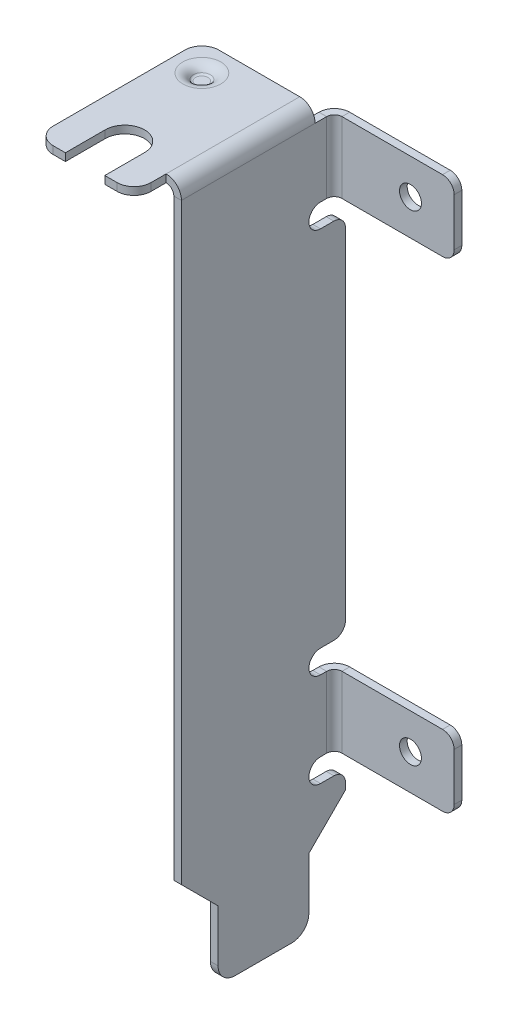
ISO-10303-21;
HEADER;
FILE_DESCRIPTION(('STEP AP214'),'2;1');
FILE_NAME('part.step','',(''),(''),'','','');
FILE_SCHEMA(('AUTOMOTIVE_DESIGN { 1 0 10303 214 1 1 1 1 }'));
ENDSEC;
DATA;
#1=APPLICATION_CONTEXT('core data for automotive mechanical design processes');
#2=APPLICATION_PROTOCOL_DEFINITION('international standard','automotive_design',2000,#1);
#3=PRODUCT_CONTEXT('',#1,'mechanical');
#4=PRODUCT('Part','Part','',(#3));
#5=PRODUCT_RELATED_PRODUCT_CATEGORY('part','',(#4));
#6=PRODUCT_DEFINITION_FORMATION('','',#4);
#7=PRODUCT_DEFINITION_CONTEXT('part definition',#1,'design');
#8=PRODUCT_DEFINITION('design','',#6,#7);
#9=PRODUCT_DEFINITION_SHAPE('','',#8);
#10=(LENGTH_UNIT() NAMED_UNIT(*) SI_UNIT(.MILLI.,.METRE.));
#11=(NAMED_UNIT(*) PLANE_ANGLE_UNIT() SI_UNIT($,.RADIAN.));
#12=(NAMED_UNIT(*) SI_UNIT($,.STERADIAN.) SOLID_ANGLE_UNIT());
#13=UNCERTAINTY_MEASURE_WITH_UNIT(LENGTH_MEASURE(1.E-05),#10,'distance_accuracy_value','');
#14=(GEOMETRIC_REPRESENTATION_CONTEXT(3) GLOBAL_UNCERTAINTY_ASSIGNED_CONTEXT((#13)) GLOBAL_UNIT_ASSIGNED_CONTEXT((#10,
#11,#12)) REPRESENTATION_CONTEXT('',''));
#15=CARTESIAN_POINT('',(0.,0.,0.));
#16=DIRECTION('',(0.,0.,1.));
#17=DIRECTION('',(1.,0.,0.));
#18=AXIS2_PLACEMENT_3D('',#15,#16,#17);
#19=CARTESIAN_POINT('',(0.,79.2,22.));
#20=DIRECTION('',(0.,-1.,0.));
#21=DIRECTION('',(0.,0.,-1.));
#22=AXIS2_PLACEMENT_3D('',#19,#20,#21);
#23=PLANE('',#22);
#24=DIRECTION('',(0.,0.,-1.));
#25=VECTOR('',#24,1.);
#26=CARTESIAN_POINT('',(-11.84,79.2,22.));
#27=LINE('',#26,#25);
#28=CARTESIAN_POINT('',(-11.84,79.2,20.09));
#29=VERTEX_POINT('',#28);
#30=CARTESIAN_POINT('',(-11.84,79.2,5.32));
#31=VERTEX_POINT('',#30);
#32=EDGE_CURVE('E881',#29,#31,#27,.T.);
#33=ORIENTED_EDGE('',*,*,#32,.T.);
#34=CARTESIAN_POINT('',(-9.93,79.2,5.32));
#35=DIRECTION('',(0.,-1.,0.));
#36=DIRECTION('',(0.,0.,-1.));
#37=AXIS2_PLACEMENT_3D('',#34,#35,#36);
#38=CIRCLE('',#37,1.91);
#39=CARTESIAN_POINT('',(-9.93,79.2,3.41));
#40=VERTEX_POINT('',#39);
#41=EDGE_CURVE('E900',#31,#40,#38,.T.);
#42=ORIENTED_EDGE('',*,*,#41,.T.);
#43=DIRECTION('',(-1.,0.,0.));
#44=VECTOR('',#43,1.);
#45=CARTESIAN_POINT('',(0.,79.2,3.41));
#46=LINE('',#45,#44);
#47=CARTESIAN_POINT('',(-0.86,79.2,3.41));
#48=VERTEX_POINT('',#47);
#49=EDGE_CURVE('E561',#48,#40,#46,.T.);
#50=ORIENTED_EDGE('',*,*,#49,.F.);
#51=DIRECTION('',(0.,0.,-1.));
#52=VECTOR('',#51,1.);
#53=CARTESIAN_POINT('',(-0.86,79.2,22.));
#54=LINE('',#53,#52);
#55=CARTESIAN_POINT('',(-0.86,79.2,18.4));
#56=VERTEX_POINT('',#55);
#57=EDGE_CURVE('E873',#56,#48,#54,.T.);
#58=ORIENTED_EDGE('',*,*,#57,.F.);
#59=CARTESIAN_POINT('',(-0.86,79.2,20.09));
#60=VERTEX_POINT('',#59);
#61=EDGE_CURVE('E879',#60,#56,#54,.T.);
#62=ORIENTED_EDGE('',*,*,#61,.F.);
#63=CARTESIAN_POINT('',(-2.77,79.2,20.09));
#64=DIRECTION('',(0.,-1.,0.));
#65=DIRECTION('',(0.,0.,-1.));
#66=AXIS2_PLACEMENT_3D('',#63,#64,#65);
#67=CIRCLE('',#66,1.91);
#68=CARTESIAN_POINT('',(-2.77,79.2,22.));
#69=VERTEX_POINT('',#68);
#70=EDGE_CURVE('E983',#60,#69,#67,.T.);
#71=ORIENTED_EDGE('',*,*,#70,.T.);
#72=DIRECTION('',(-1.,0.,0.));
#73=VECTOR('',#72,1.);
#74=CARTESIAN_POINT('',(0.,79.2,22.));
#75=LINE('',#74,#73);
#76=CARTESIAN_POINT('',(-4.14,79.2,22.));
#77=VERTEX_POINT('',#76);
#78=EDGE_CURVE('E629',#69,#77,#75,.T.);
#79=ORIENTED_EDGE('',*,*,#78,.T.);
#80=DIRECTION('',(0.,0.,-1.));
#81=VECTOR('',#80,1.);
#82=CARTESIAN_POINT('',(-4.14,79.2,17.54));
#83=LINE('',#82,#81);
#84=CARTESIAN_POINT('',(-4.14,79.2,17.54));
#85=VERTEX_POINT('',#84);
#86=EDGE_CURVE('E381',#77,#85,#83,.T.);
#87=ORIENTED_EDGE('',*,*,#86,.T.);
#88=CARTESIAN_POINT('',(-6.35,79.2,17.54));
#89=DIRECTION('',(0.,-1.,0.));
#90=DIRECTION('',(0.,0.,-1.));
#91=AXIS2_PLACEMENT_3D('',#88,#89,#90);
#92=CIRCLE('',#91,2.21);
#93=CARTESIAN_POINT('',(-8.56,79.2,17.54));
#94=VERTEX_POINT('',#93);
#95=EDGE_CURVE('E404',#85,#94,#92,.F.);
#96=ORIENTED_EDGE('',*,*,#95,.T.);
#97=DIRECTION('',(0.,0.,1.));
#98=VECTOR('',#97,1.);
#99=CARTESIAN_POINT('',(-8.56,79.2,22.));
#100=LINE('',#99,#98);
#101=CARTESIAN_POINT('',(-8.56,79.2,22.));
#102=VERTEX_POINT('',#101);
#103=EDGE_CURVE('E401',#94,#102,#100,.T.);
#104=ORIENTED_EDGE('',*,*,#103,.T.);
#105=CARTESIAN_POINT('',(-9.93,79.2,22.));
#106=VERTEX_POINT('',#105);
#107=EDGE_CURVE('E371',#102,#106,#75,.T.);
#108=ORIENTED_EDGE('',*,*,#107,.T.);
#109=CARTESIAN_POINT('',(-9.93,79.2,20.09));
#110=DIRECTION('',(0.,-1.,0.));
#111=DIRECTION('',(0.,0.,-1.));
#112=AXIS2_PLACEMENT_3D('',#109,#110,#111);
#113=CIRCLE('',#112,1.91);
#114=EDGE_CURVE('E899',#106,#29,#113,.T.);
#115=ORIENTED_EDGE('',*,*,#114,.T.);
#116=EDGE_LOOP('',(#33,#42,#50,#58,#62,#71,#79,#87,#96,#104,#108,#115));
#117=FACE_BOUND('',#116,.T.);
#118=CARTESIAN_POINT('',(-8.66,79.1999999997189,6.59));
#119=DIRECTION('',(0.,1.,0.));
#120=DIRECTION('',(0.,0.,1.));
#121=AXIS2_PLACEMENT_3D('',#118,#119,#120);
#122=CIRCLE('',#121,2.13593175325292);
#123=CARTESIAN_POINT('',(-8.66,79.1999999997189,8.72593175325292));
#124=VERTEX_POINT('',#123);
#125=EDGE_CURVE('E1790',#124,#124,#122,.F.);
#126=ORIENTED_EDGE('',*,*,#125,.F.);
#127=EDGE_LOOP('',(#126));
#128=FACE_BOUND('',#127,.T.);
#129=ADVANCED_FACE('F42',(#117,#128),#23,.T.);
#130=CARTESIAN_POINT('',(0.,80.06,22.));
#131=DIRECTION('',(0.,-1.,0.));
#132=DIRECTION('',(0.,0.,-1.));
#133=AXIS2_PLACEMENT_3D('',#130,#131,#132);
#134=PLANE('',#133);
#135=DIRECTION('',(1.,0.,0.));
#136=VECTOR('',#135,1.);
#137=CARTESIAN_POINT('',(0.,80.06,3.41));
#138=LINE('',#137,#136);
#139=CARTESIAN_POINT('',(-0.86,80.06,3.41));
#140=VERTEX_POINT('',#139);
#141=CARTESIAN_POINT('',(-9.93,80.06,3.41));
#142=VERTEX_POINT('',#141);
#143=EDGE_CURVE('E562',#140,#142,#138,.F.);
#144=ORIENTED_EDGE('',*,*,#143,.T.);
#145=CARTESIAN_POINT('',(-9.93,80.06,5.32));
#146=DIRECTION('',(0.,-1.,0.));
#147=DIRECTION('',(0.,0.,-1.));
#148=AXIS2_PLACEMENT_3D('',#145,#146,#147);
#149=CIRCLE('',#148,1.91);
#150=CARTESIAN_POINT('',(-11.84,80.06,5.32));
#151=VERTEX_POINT('',#150);
#152=EDGE_CURVE('E991',#142,#151,#149,.F.);
#153=ORIENTED_EDGE('',*,*,#152,.T.);
#154=DIRECTION('',(0.,0.,-1.));
#155=VECTOR('',#154,1.);
#156=CARTESIAN_POINT('',(-11.84,80.06,22.));
#157=LINE('',#156,#155);
#158=CARTESIAN_POINT('',(-11.84,80.06,20.09));
#159=VERTEX_POINT('',#158);
#160=EDGE_CURVE('E701',#159,#151,#157,.T.);
#161=ORIENTED_EDGE('',*,*,#160,.F.);
#162=CARTESIAN_POINT('',(-9.93,80.06,20.09));
#163=DIRECTION('',(0.,-1.,0.));
#164=DIRECTION('',(0.,0.,-1.));
#165=AXIS2_PLACEMENT_3D('',#162,#163,#164);
#166=CIRCLE('',#165,1.91);
#167=CARTESIAN_POINT('',(-9.93,80.06,22.));
#168=VERTEX_POINT('',#167);
#169=EDGE_CURVE('E897',#159,#168,#166,.F.);
#170=ORIENTED_EDGE('',*,*,#169,.T.);
#171=DIRECTION('',(1.,0.,0.));
#172=VECTOR('',#171,1.);
#173=CARTESIAN_POINT('',(0.,80.06,22.));
#174=LINE('',#173,#172);
#175=CARTESIAN_POINT('',(-8.56,80.06,22.));
#176=VERTEX_POINT('',#175);
#177=EDGE_CURVE('E372',#176,#168,#174,.F.);
#178=ORIENTED_EDGE('',*,*,#177,.F.);
#179=DIRECTION('',(0.,0.,-1.));
#180=VECTOR('',#179,1.);
#181=CARTESIAN_POINT('',(-8.56,80.06,22.));
#182=LINE('',#181,#180);
#183=CARTESIAN_POINT('',(-8.56,80.06,17.54));
#184=VERTEX_POINT('',#183);
#185=EDGE_CURVE('E394',#184,#176,#182,.F.);
#186=ORIENTED_EDGE('',*,*,#185,.F.);
#187=CARTESIAN_POINT('',(-6.35,80.06,17.54));
#188=DIRECTION('',(0.,-1.,0.));
#189=DIRECTION('',(0.,0.,-1.));
#190=AXIS2_PLACEMENT_3D('',#187,#188,#189);
#191=CIRCLE('',#190,2.21);
#192=CARTESIAN_POINT('',(-4.14,80.06,17.54));
#193=VERTEX_POINT('',#192);
#194=EDGE_CURVE('E390',#193,#184,#191,.F.);
#195=ORIENTED_EDGE('',*,*,#194,.F.);
#196=DIRECTION('',(0.,0.,-1.));
#197=VECTOR('',#196,1.);
#198=CARTESIAN_POINT('',(-4.14,80.06,22.));
#199=LINE('',#198,#197);
#200=CARTESIAN_POINT('',(-4.14,80.06,22.));
#201=VERTEX_POINT('',#200);
#202=EDGE_CURVE('E378',#201,#193,#199,.T.);
#203=ORIENTED_EDGE('',*,*,#202,.F.);
#204=CARTESIAN_POINT('',(-2.77,80.06,22.));
#205=VERTEX_POINT('',#204);
#206=EDGE_CURVE('E362',#205,#201,#174,.F.);
#207=ORIENTED_EDGE('',*,*,#206,.F.);
#208=CARTESIAN_POINT('',(-2.77,80.06,20.09));
#209=DIRECTION('',(0.,-1.,0.));
#210=DIRECTION('',(0.,0.,-1.));
#211=AXIS2_PLACEMENT_3D('',#208,#209,#210);
#212=CIRCLE('',#211,1.91);
#213=CARTESIAN_POINT('',(-0.86,80.06,20.09));
#214=VERTEX_POINT('',#213);
#215=EDGE_CURVE('E994',#205,#214,#212,.F.);
#216=ORIENTED_EDGE('',*,*,#215,.T.);
#217=DIRECTION('',(0.,0.,-1.));
#218=VECTOR('',#217,1.);
#219=CARTESIAN_POINT('',(-0.86,80.06,22.));
#220=LINE('',#219,#218);
#221=CARTESIAN_POINT('',(-0.86,80.06,18.4));
#222=VERTEX_POINT('',#221);
#223=EDGE_CURVE('E1005',#214,#222,#220,.T.);
#224=ORIENTED_EDGE('',*,*,#223,.T.);
#225=EDGE_CURVE('E631',#222,#140,#220,.T.);
#226=ORIENTED_EDGE('',*,*,#225,.T.);
#227=EDGE_LOOP('',(#144,#153,#161,#170,#178,#186,#195,#203,#207,#216,#224,#226));
#228=FACE_BOUND('',#227,.T.);
#229=CARTESIAN_POINT('',(-8.66,80.0599999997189,6.59));
#230=DIRECTION('',(0.,1.,0.));
#231=DIRECTION('',(0.,0.,1.));
#232=AXIS2_PLACEMENT_3D('',#229,#230,#231);
#233=CIRCLE('',#232,2.13593175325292);
#234=CARTESIAN_POINT('',(-8.66,80.0599999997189,8.72593175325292));
#235=VERTEX_POINT('',#234);
#236=EDGE_CURVE('E1795',#235,#235,#233,.F.);
#237=ORIENTED_EDGE('',*,*,#236,.T.);
#238=EDGE_LOOP('',(#237));
#239=FACE_BOUND('',#238,.T.);
#240=ADVANCED_FACE('F387',(#228,#239),#134,.F.);
#241=CARTESIAN_POINT('',(0.86,78.3399999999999,22.));
#242=DIRECTION('',(0.,0.,1.));
#243=DIRECTION('',(1.,0.,0.));
#244=AXIS2_PLACEMENT_3D('',#241,#242,#243);
#245=PLANE('',#244);
#246=ORIENTED_EDGE('',*,*,#78,.F.);
#247=DIRECTION('',(0.,1.,0.));
#248=VECTOR('',#247,1.);
#249=CARTESIAN_POINT('',(-2.77,78.3399999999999,22.));
#250=LINE('',#249,#248);
#251=EDGE_CURVE('E368',#69,#205,#250,.T.);
#252=ORIENTED_EDGE('',*,*,#251,.T.);
#253=ORIENTED_EDGE('',*,*,#206,.T.);
#254=DIRECTION('',(0.,-1.,0.));
#255=VECTOR('',#254,1.);
#256=CARTESIAN_POINT('',(-4.14,79.2,22.));
#257=LINE('',#256,#255);
#258=EDGE_CURVE('E366',#77,#201,#257,.F.);
#259=ORIENTED_EDGE('',*,*,#258,.F.);
#260=EDGE_LOOP('',(#246,#252,#253,#259));
#261=FACE_BOUND('',#260,.T.);
#262=ADVANCED_FACE('F365',(#261),#245,.T.);
#263=ORIENTED_EDGE('',*,*,#177,.T.);
#264=DIRECTION('',(0.,1.,0.));
#265=VECTOR('',#264,1.);
#266=CARTESIAN_POINT('',(-9.93,78.3399999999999,22.));
#267=LINE('',#266,#265);
#268=EDGE_CURVE('E891',#168,#106,#267,.F.);
#269=ORIENTED_EDGE('',*,*,#268,.T.);
#270=ORIENTED_EDGE('',*,*,#107,.F.);
#271=DIRECTION('',(0.,-1.,0.));
#272=VECTOR('',#271,1.);
#273=CARTESIAN_POINT('',(-8.56,79.2,22.));
#274=LINE('',#273,#272);
#275=EDGE_CURVE('E383',#102,#176,#274,.F.);
#276=ORIENTED_EDGE('',*,*,#275,.T.);
#277=EDGE_LOOP('',(#263,#269,#270,#276));
#278=FACE_BOUND('',#277,.T.);
#279=ADVANCED_FACE('F889',(#278),#245,.T.);
#280=CARTESIAN_POINT('',(-0.86,78.34,22.));
#281=DIRECTION('',(0.,0.,-1.));
#282=DIRECTION('',(-1.,0.,0.));
#283=AXIS2_PLACEMENT_3D('',#280,#281,#282);
#284=CYLINDRICAL_SURFACE('',#283,0.86);
#285=DIRECTION('',(0.,0.,-1.));
#286=VECTOR('',#285,1.);
#287=CARTESIAN_POINT('',(0.,78.3399999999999,22.));
#288=LINE('',#287,#286);
#289=CARTESIAN_POINT('',(0.,78.3399999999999,18.4));
#290=VERTEX_POINT('',#289);
#291=CARTESIAN_POINT('',(0.,78.3399999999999,3.41));
#292=VERTEX_POINT('',#291);
#293=EDGE_CURVE('E870',#290,#292,#288,.T.);
#294=ORIENTED_EDGE('',*,*,#293,.F.);
#295=CARTESIAN_POINT('',(-0.86,78.34,18.4));
#296=DIRECTION('',(0.,0.,-1.));
#297=DIRECTION('',(-1.,0.,0.));
#298=AXIS2_PLACEMENT_3D('',#295,#296,#297);
#299=CIRCLE('',#298,0.86);
#300=EDGE_CURVE('E411',#290,#56,#299,.F.);
#301=ORIENTED_EDGE('',*,*,#300,.T.);
#302=ORIENTED_EDGE('',*,*,#57,.T.);
#303=CARTESIAN_POINT('',(-0.86,78.34,3.41));
#304=DIRECTION('',(0.,0.,1.));
#305=DIRECTION('',(1.,0.,0.));
#306=AXIS2_PLACEMENT_3D('',#303,#304,#305);
#307=CIRCLE('',#306,0.86);
#308=EDGE_CURVE('E555',#292,#48,#307,.T.);
#309=ORIENTED_EDGE('',*,*,#308,.F.);
#310=EDGE_LOOP('',(#294,#301,#302,#309));
#311=FACE_BOUND('',#310,.T.);
#312=ADVANCED_FACE('F938',(#311),#284,.F.);
#313=CARTESIAN_POINT('',(-0.86,78.34,22.));
#314=DIRECTION('',(0.,0.,-1.));
#315=DIRECTION('',(-1.,0.,0.));
#316=AXIS2_PLACEMENT_3D('',#313,#314,#315);
#317=CYLINDRICAL_SURFACE('',#316,1.72);
#318=CARTESIAN_POINT('',(-0.86,78.34,18.4));
#319=DIRECTION('',(0.,0.,-1.));
#320=DIRECTION('',(-1.,0.,0.));
#321=AXIS2_PLACEMENT_3D('',#318,#319,#320);
#322=CIRCLE('',#321,1.72);
#323=CARTESIAN_POINT('',(0.86,78.3399999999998,18.4));
#324=VERTEX_POINT('',#323);
#325=EDGE_CURVE('E413',#324,#222,#322,.F.);
#326=ORIENTED_EDGE('',*,*,#325,.F.);
#327=DIRECTION('',(0.,0.,-1.));
#328=VECTOR('',#327,1.);
#329=CARTESIAN_POINT('',(0.86,78.3399999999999,22.));
#330=LINE('',#329,#328);
#331=CARTESIAN_POINT('',(0.86,78.3399999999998,3.41));
#332=VERTEX_POINT('',#331);
#333=EDGE_CURVE('E875',#324,#332,#330,.T.);
#334=ORIENTED_EDGE('',*,*,#333,.T.);
#335=CARTESIAN_POINT('',(-0.86,78.34,3.41));
#336=DIRECTION('',(0.,0.,-1.));
#337=DIRECTION('',(-1.,0.,0.));
#338=AXIS2_PLACEMENT_3D('',#335,#336,#337);
#339=CIRCLE('',#338,1.72);
#340=EDGE_CURVE('E550',#332,#140,#339,.F.);
#341=ORIENTED_EDGE('',*,*,#340,.T.);
#342=ORIENTED_EDGE('',*,*,#225,.F.);
#343=EDGE_LOOP('',(#326,#334,#341,#342));
#344=FACE_BOUND('',#343,.T.);
#345=ADVANCED_FACE('F955',(#344),#317,.T.);
#346=CARTESIAN_POINT('',(0.,16.4800000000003,-5.66387214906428E-13));
#347=DIRECTION('',(0.,-1.,0.));
#348=DIRECTION('',(0.,0.,-1.));
#349=AXIS2_PLACEMENT_3D('',#346,#347,#348);
#350=PLANE('',#349);
#351=DIRECTION('',(0.,0.,-1.));
#352=VECTOR('',#351,1.);
#353=CARTESIAN_POINT('',(0.,16.4800000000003,-5.66387214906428E-13));
#354=LINE('',#353,#352);
#355=CARTESIAN_POINT('',(0.,16.4800000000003,2.79999999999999));
#356=VERTEX_POINT('',#355);
#357=CARTESIAN_POINT('',(0.,16.4800000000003,2.10999999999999));
#358=VERTEX_POINT('',#357);
#359=EDGE_CURVE('E733',#356,#358,#354,.T.);
#360=ORIENTED_EDGE('',*,*,#359,.T.);
#361=DIRECTION('',(1.,0.,0.));
#362=VECTOR('',#361,1.);
#363=CARTESIAN_POINT('',(0.,16.4800000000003,2.10999999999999));
#364=LINE('',#363,#362);
#365=CARTESIAN_POINT('',(0.86,16.4800000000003,2.10999999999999));
#366=VERTEX_POINT('',#365);
#367=EDGE_CURVE('E729',#358,#366,#364,.T.);
#368=ORIENTED_EDGE('',*,*,#367,.T.);
#369=DIRECTION('',(0.,0.,-1.));
#370=VECTOR('',#369,1.);
#371=CARTESIAN_POINT('',(0.86,16.4800000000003,-5.66387214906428E-13));
#372=LINE('',#371,#370);
#373=CARTESIAN_POINT('',(0.86,16.4800000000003,2.79999999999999));
#374=VERTEX_POINT('',#373);
#375=EDGE_CURVE('E547',#374,#366,#372,.T.);
#376=ORIENTED_EDGE('',*,*,#375,.F.);
#377=DIRECTION('',(-1.,0.,0.));
#378=VECTOR('',#377,1.);
#379=CARTESIAN_POINT('',(0.86005,16.4800000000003,2.79999999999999));
#380=LINE('',#379,#378);
#381=EDGE_CURVE('E521',#374,#356,#380,.T.);
#382=ORIENTED_EDGE('',*,*,#381,.T.);
#383=EDGE_LOOP('',(#360,#368,#376,#382));
#384=FACE_BOUND('',#383,.T.);
#385=ADVANCED_FACE('F951',(#384),#350,.T.);
#386=CARTESIAN_POINT('',(0.,24.4399999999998,-5.66387214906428E-13));
#387=DIRECTION('',(0.,1.,0.));
#388=DIRECTION('',(0.,0.,1.));
#389=AXIS2_PLACEMENT_3D('',#386,#387,#388);
#390=PLANE('',#389);
#391=DIRECTION('',(0.,0.,1.));
#392=VECTOR('',#391,1.);
#393=CARTESIAN_POINT('',(0.86,24.4399999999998,-5.66387214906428E-13));
#394=LINE('',#393,#392);
#395=CARTESIAN_POINT('',(0.86,24.4399999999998,2.10999999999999));
#396=VERTEX_POINT('',#395);
#397=CARTESIAN_POINT('',(0.86,24.4399999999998,2.79999999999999));
#398=VERTEX_POINT('',#397);
#399=EDGE_CURVE('E737',#396,#398,#394,.T.);
#400=ORIENTED_EDGE('',*,*,#399,.F.);
#401=DIRECTION('',(-1.,0.,0.));
#402=VECTOR('',#401,1.);
#403=CARTESIAN_POINT('',(0.,24.4399999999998,2.10999999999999));
#404=LINE('',#403,#402);
#405=CARTESIAN_POINT('',(0.,24.4399999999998,2.10999999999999));
#406=VERTEX_POINT('',#405);
#407=EDGE_CURVE('E724',#396,#406,#404,.T.);
#408=ORIENTED_EDGE('',*,*,#407,.T.);
#409=DIRECTION('',(0.,0.,1.));
#410=VECTOR('',#409,1.);
#411=CARTESIAN_POINT('',(0.,24.4399999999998,-5.66387214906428E-13));
#412=LINE('',#411,#410);
#413=CARTESIAN_POINT('',(0.,24.4399999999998,2.79999999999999));
#414=VERTEX_POINT('',#413);
#415=EDGE_CURVE('E736',#406,#414,#412,.T.);
#416=ORIENTED_EDGE('',*,*,#415,.T.);
#417=DIRECTION('',(-1.,0.,0.));
#418=VECTOR('',#417,1.);
#419=CARTESIAN_POINT('',(0.86005,24.4399999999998,2.79999999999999));
#420=LINE('',#419,#418);
#421=EDGE_CURVE('E533',#398,#414,#420,.T.);
#422=ORIENTED_EDGE('',*,*,#421,.F.);
#423=EDGE_LOOP('',(#400,#408,#416,#422));
#424=FACE_BOUND('',#423,.T.);
#425=ADVANCED_FACE('F948',(#424),#390,.T.);
#426=CARTESIAN_POINT('',(0.,0.,22.));
#427=DIRECTION('',(-1.,0.,0.));
#428=DIRECTION('',(0.,0.,1.));
#429=AXIS2_PLACEMENT_3D('',#426,#427,#428);
#430=PLANE('',#429);
#431=DIRECTION('',(0.,0.,1.));
#432=VECTOR('',#431,1.);
#433=CARTESIAN_POINT('',(0.,13.8800000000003,0.));
#434=LINE('',#433,#432);
#435=CARTESIAN_POINT('',(0.,13.8800000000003,1.29999999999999));
#436=VERTEX_POINT('',#435);
#437=CARTESIAN_POINT('',(0.,13.8800000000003,2.79999999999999));
#438=VERTEX_POINT('',#437);
#439=EDGE_CURVE('E519',#436,#438,#434,.T.);
#440=ORIENTED_EDGE('',*,*,#439,.F.);
#441=CARTESIAN_POINT('',(0.,12.5800000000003,1.3));
#442=DIRECTION('',(-1.,0.,0.));
#443=DIRECTION('',(0.,0.,1.));
#444=AXIS2_PLACEMENT_3D('',#441,#442,#443);
#445=CIRCLE('',#444,1.3);
#446=CARTESIAN_POINT('',(0.,12.5800000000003,0.));
#447=VERTEX_POINT('',#446);
#448=EDGE_CURVE('E650',#436,#447,#445,.T.);
#449=ORIENTED_EDGE('',*,*,#448,.T.);
#450=DIRECTION('',(0.,1.,0.));
#451=VECTOR('',#450,1.);
#452=CARTESIAN_POINT('',(0.,0.,0.));
#453=LINE('',#452,#451);
#454=CARTESIAN_POINT('',(0.,11.8500000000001,0.));
#455=VERTEX_POINT('',#454);
#456=EDGE_CURVE('E638',#455,#447,#453,.T.);
#457=ORIENTED_EDGE('',*,*,#456,.F.);
#458=DIRECTION('',(0.,0.707106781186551,-0.707106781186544));
#459=VECTOR('',#458,1.);
#460=CARTESIAN_POINT('',(0.,-5.07500000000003,16.9249999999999));
#461=LINE('',#460,#459);
#462=CARTESIAN_POINT('',(0.,7.74000000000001,4.11));
#463=VERTEX_POINT('',#462);
#464=EDGE_CURVE('E615',#463,#455,#461,.T.);
#465=ORIENTED_EDGE('',*,*,#464,.F.);
#466=DIRECTION('',(0.,1.,0.));
#467=VECTOR('',#466,1.);
#468=CARTESIAN_POINT('',(0.,0.,4.11));
#469=LINE('',#468,#467);
#470=CARTESIAN_POINT('',(0.,1.91,4.11));
#471=VERTEX_POINT('',#470);
#472=EDGE_CURVE('E600',#471,#463,#469,.T.);
#473=ORIENTED_EDGE('',*,*,#472,.F.);
#474=CARTESIAN_POINT('',(0.,1.91,6.02));
#475=DIRECTION('',(-1.,0.,0.));
#476=DIRECTION('',(0.,0.,1.));
#477=AXIS2_PLACEMENT_3D('',#474,#475,#476);
#478=CIRCLE('',#477,1.91);
#479=CARTESIAN_POINT('',(0.,0.,6.02));
#480=VERTEX_POINT('',#479);
#481=EDGE_CURVE('E607',#480,#471,#478,.F.);
#482=ORIENTED_EDGE('',*,*,#481,.F.);
#483=DIRECTION('',(0.,0.,-1.));
#484=VECTOR('',#483,1.);
#485=CARTESIAN_POINT('',(0.,0.,22.));
#486=LINE('',#485,#484);
#487=CARTESIAN_POINT('',(0.,0.,12.38));
#488=VERTEX_POINT('',#487);
#489=EDGE_CURVE('E868',#488,#480,#486,.T.);
#490=ORIENTED_EDGE('',*,*,#489,.F.);
#491=CARTESIAN_POINT('',(0.,1.91,12.38));
#492=DIRECTION('',(-1.,0.,0.));
#493=DIRECTION('',(0.,0.,1.));
#494=AXIS2_PLACEMENT_3D('',#491,#492,#493);
#495=CIRCLE('',#494,1.91);
#496=CARTESIAN_POINT('',(0.,1.91,14.29));
#497=VERTEX_POINT('',#496);
#498=EDGE_CURVE('E585',#497,#488,#495,.F.);
#499=ORIENTED_EDGE('',*,*,#498,.F.);
#500=DIRECTION('',(0.,-1.,0.));
#501=VECTOR('',#500,1.);
#502=CARTESIAN_POINT('',(0.,0.,14.29));
#503=LINE('',#502,#501);
#504=CARTESIAN_POINT('',(0.,7.74000000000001,14.29));
#505=VERTEX_POINT('',#504);
#506=EDGE_CURVE('E569',#505,#497,#503,.T.);
#507=ORIENTED_EDGE('',*,*,#506,.F.);
#508=DIRECTION('',(0.,-0.707106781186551,-0.707106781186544));
#509=VECTOR('',#508,1.);
#510=CARTESIAN_POINT('',(0.,7.72499999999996,14.275));
#511=LINE('',#510,#509);
#512=CARTESIAN_POINT('',(0.,11.8500000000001,18.4));
#513=VERTEX_POINT('',#512);
#514=EDGE_CURVE('E574',#513,#505,#511,.T.);
#515=ORIENTED_EDGE('',*,*,#514,.F.);
#516=DIRECTION('',(0.,-1.,0.));
#517=VECTOR('',#516,1.);
#518=CARTESIAN_POINT('',(0.,0.,18.4));
#519=LINE('',#518,#517);
#520=EDGE_CURVE('E587',#290,#513,#519,.T.);
#521=ORIENTED_EDGE('',*,*,#520,.F.);
#522=ORIENTED_EDGE('',*,*,#293,.T.);
#523=DIRECTION('',(0.,0.,1.));
#524=VECTOR('',#523,1.);
#525=CARTESIAN_POINT('',(0.,78.3399999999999,22.));
#526=LINE('',#525,#524);
#527=CARTESIAN_POINT('',(0.,78.3399999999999,2.11));
#528=VERTEX_POINT('',#527);
#529=EDGE_CURVE('E558',#528,#292,#526,.T.);
#530=ORIENTED_EDGE('',*,*,#529,.F.);
#531=DIRECTION('',(0.,1.,0.));
#532=VECTOR('',#531,1.);
#533=CARTESIAN_POINT('',(0.,0.,2.10999999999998));
#534=LINE('',#533,#532);
#535=CARTESIAN_POINT('',(0.,70.3800000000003,2.11));
#536=VERTEX_POINT('',#535);
#537=EDGE_CURVE('E709',#536,#528,#534,.T.);
#538=ORIENTED_EDGE('',*,*,#537,.F.);
#539=DIRECTION('',(0.,0.,-1.));
#540=VECTOR('',#539,1.);
#541=CARTESIAN_POINT('',(0.,70.3800000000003,0.));
#542=LINE('',#541,#540);
#543=CARTESIAN_POINT('',(0.,70.3800000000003,2.8));
#544=VERTEX_POINT('',#543);
#545=EDGE_CURVE('E745',#544,#536,#542,.T.);
#546=ORIENTED_EDGE('',*,*,#545,.F.);
#547=CARTESIAN_POINT('',(0.,69.0800000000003,2.8));
#548=DIRECTION('',(-1.,0.,0.));
#549=DIRECTION('',(0.,0.,1.));
#550=AXIS2_PLACEMENT_3D('',#547,#548,#549);
#551=CIRCLE('',#550,1.29999999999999);
#552=CARTESIAN_POINT('',(0.,67.7800000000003,2.8));
#553=VERTEX_POINT('',#552);
#554=EDGE_CURVE('E536',#553,#544,#551,.T.);
#555=ORIENTED_EDGE('',*,*,#554,.F.);
#556=DIRECTION('',(0.,0.,1.));
#557=VECTOR('',#556,1.);
#558=CARTESIAN_POINT('',(0.,67.7800000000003,0.));
#559=LINE('',#558,#557);
#560=CARTESIAN_POINT('',(0.,67.7800000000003,1.29999999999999));
#561=VERTEX_POINT('',#560);
#562=EDGE_CURVE('E541',#561,#553,#559,.T.);
#563=ORIENTED_EDGE('',*,*,#562,.F.);
#564=CARTESIAN_POINT('',(0.,66.4800000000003,1.3));
#565=DIRECTION('',(-1.,0.,0.));
#566=DIRECTION('',(0.,0.,1.));
#567=AXIS2_PLACEMENT_3D('',#564,#565,#566);
#568=CIRCLE('',#567,1.3);
#569=CARTESIAN_POINT('',(0.,66.4800000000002,0.));
#570=VERTEX_POINT('',#569);
#571=EDGE_CURVE('E646',#561,#570,#568,.T.);
#572=ORIENTED_EDGE('',*,*,#571,.T.);
#573=CARTESIAN_POINT('',(0.,28.3399999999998,0.));
#574=VERTEX_POINT('',#573);
#575=EDGE_CURVE('E626',#574,#570,#453,.T.);
#576=ORIENTED_EDGE('',*,*,#575,.F.);
#577=CARTESIAN_POINT('',(0.,28.3399999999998,1.3));
#578=DIRECTION('',(-1.,0.,0.));
#579=DIRECTION('',(0.,0.,1.));
#580=AXIS2_PLACEMENT_3D('',#577,#578,#579);
#581=CIRCLE('',#580,1.3);
#582=CARTESIAN_POINT('',(0.,27.0399999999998,1.29999999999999));
#583=VERTEX_POINT('',#582);
#584=EDGE_CURVE('E648',#574,#583,#581,.T.);
#585=ORIENTED_EDGE('',*,*,#584,.T.);
#586=DIRECTION('',(0.,0.,-1.));
#587=VECTOR('',#586,1.);
#588=CARTESIAN_POINT('',(0.,27.0399999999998,0.));
#589=LINE('',#588,#587);
#590=CARTESIAN_POINT('',(0.,27.0399999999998,2.79999999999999));
#591=VERTEX_POINT('',#590);
#592=EDGE_CURVE('E530',#591,#583,#589,.T.);
#593=ORIENTED_EDGE('',*,*,#592,.F.);
#594=CARTESIAN_POINT('',(0.,25.7399999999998,2.79999999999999));
#595=DIRECTION('',(-1.,0.,0.));
#596=DIRECTION('',(0.,0.,-1.));
#597=AXIS2_PLACEMENT_3D('',#594,#595,#596);
#598=CIRCLE('',#597,1.29999999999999);
#599=EDGE_CURVE('E525',#414,#591,#598,.T.);
#600=ORIENTED_EDGE('',*,*,#599,.F.);
#601=ORIENTED_EDGE('',*,*,#415,.F.);
#602=DIRECTION('',(0.,-1.,0.));
#603=VECTOR('',#602,1.);
#604=CARTESIAN_POINT('',(0.,0.,2.10999999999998));
#605=LINE('',#604,#603);
#606=EDGE_CURVE('E721',#406,#358,#605,.T.);
#607=ORIENTED_EDGE('',*,*,#606,.T.);
#608=ORIENTED_EDGE('',*,*,#359,.F.);
#609=CARTESIAN_POINT('',(0.,15.1800000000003,2.79999999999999));
#610=DIRECTION('',(-1.,0.,0.));
#611=DIRECTION('',(0.,0.,1.));
#612=AXIS2_PLACEMENT_3D('',#609,#610,#611);
#613=CIRCLE('',#612,1.29999999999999);
#614=EDGE_CURVE('E512',#438,#356,#613,.T.);
#615=ORIENTED_EDGE('',*,*,#614,.F.);
#616=EDGE_LOOP('',(#440,#449,#457,#465,#473,#482,#490,#499,#507,#515,#521,#522,#530,#538,#546,
#555,#563,#572,#576,#585,#593,#600,#601,#607,#608,#615));
#617=FACE_BOUND('',#616,.T.);
#618=ADVANCED_FACE('F687',(#617),#430,.T.);
#619=CARTESIAN_POINT('',(0.86,0.,22.));
#620=DIRECTION('',(-1.,0.,0.));
#621=DIRECTION('',(0.,0.,1.));
#622=AXIS2_PLACEMENT_3D('',#619,#620,#621);
#623=PLANE('',#622);
#624=DIRECTION('',(0.,1.,0.));
#625=VECTOR('',#624,1.);
#626=CARTESIAN_POINT('',(0.86,0.,0.));
#627=LINE('',#626,#625);
#628=CARTESIAN_POINT('',(0.86,11.8500000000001,0.));
#629=VERTEX_POINT('',#628);
#630=CARTESIAN_POINT('',(0.86,12.5800000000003,0.));
#631=VERTEX_POINT('',#630);
#632=EDGE_CURVE('E656',#629,#631,#627,.T.);
#633=ORIENTED_EDGE('',*,*,#632,.T.);
#634=CARTESIAN_POINT('',(0.86,12.5800000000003,1.3));
#635=DIRECTION('',(-1.,0.,0.));
#636=DIRECTION('',(0.,0.,1.));
#637=AXIS2_PLACEMENT_3D('',#634,#635,#636);
#638=CIRCLE('',#637,1.3);
#639=CARTESIAN_POINT('',(0.86,13.8800000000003,1.29999999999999));
#640=VERTEX_POINT('',#639);
#641=EDGE_CURVE('E660',#631,#640,#638,.F.);
#642=ORIENTED_EDGE('',*,*,#641,.T.);
#643=DIRECTION('',(0.,0.,1.));
#644=VECTOR('',#643,1.);
#645=CARTESIAN_POINT('',(0.86,13.8800000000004,21.9999999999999));
#646=LINE('',#645,#644);
#647=CARTESIAN_POINT('',(0.86,13.8800000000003,2.79999999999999));
#648=VERTEX_POINT('',#647);
#649=EDGE_CURVE('E707',#640,#648,#646,.T.);
#650=ORIENTED_EDGE('',*,*,#649,.T.);
#651=CARTESIAN_POINT('',(0.86,15.1800000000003,2.79999999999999));
#652=DIRECTION('',(-1.,0.,0.));
#653=DIRECTION('',(0.,0.,1.));
#654=AXIS2_PLACEMENT_3D('',#651,#652,#653);
#655=CIRCLE('',#654,1.29999999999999);
#656=EDGE_CURVE('E679',#648,#374,#655,.T.);
#657=ORIENTED_EDGE('',*,*,#656,.T.);
#658=ORIENTED_EDGE('',*,*,#375,.T.);
#659=DIRECTION('',(0.,-1.,0.));
#660=VECTOR('',#659,1.);
#661=CARTESIAN_POINT('',(0.86,0.,2.10999999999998));
#662=LINE('',#661,#660);
#663=EDGE_CURVE('E727',#396,#366,#662,.T.);
#664=ORIENTED_EDGE('',*,*,#663,.F.);
#665=ORIENTED_EDGE('',*,*,#399,.T.);
#666=CARTESIAN_POINT('',(0.86,25.7399999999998,2.79999999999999));
#667=DIRECTION('',(-1.,0.,0.));
#668=DIRECTION('',(0.,0.,1.));
#669=AXIS2_PLACEMENT_3D('',#666,#667,#668);
#670=CIRCLE('',#669,1.29999999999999);
#671=CARTESIAN_POINT('',(0.86,27.0399999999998,2.79999999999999));
#672=VERTEX_POINT('',#671);
#673=EDGE_CURVE('E678',#398,#672,#670,.T.);
#674=ORIENTED_EDGE('',*,*,#673,.T.);
#675=DIRECTION('',(0.,0.,-1.));
#676=VECTOR('',#675,1.);
#677=CARTESIAN_POINT('',(0.86,27.0399999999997,22.0000000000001));
#678=LINE('',#677,#676);
#679=CARTESIAN_POINT('',(0.86,27.0399999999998,1.29999999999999));
#680=VERTEX_POINT('',#679);
#681=EDGE_CURVE('E669',#672,#680,#678,.T.);
#682=ORIENTED_EDGE('',*,*,#681,.T.);
#683=CARTESIAN_POINT('',(0.86,28.3399999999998,1.3));
#684=DIRECTION('',(-1.,0.,0.));
#685=DIRECTION('',(0.,0.,1.));
#686=AXIS2_PLACEMENT_3D('',#683,#684,#685);
#687=CIRCLE('',#686,1.3);
#688=CARTESIAN_POINT('',(0.86,28.3399999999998,0.));
#689=VERTEX_POINT('',#688);
#690=EDGE_CURVE('E658',#680,#689,#687,.F.);
#691=ORIENTED_EDGE('',*,*,#690,.T.);
#692=CARTESIAN_POINT('',(0.86,66.4800000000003,0.));
#693=VERTEX_POINT('',#692);
#694=EDGE_CURVE('E654',#689,#693,#627,.T.);
#695=ORIENTED_EDGE('',*,*,#694,.T.);
#696=CARTESIAN_POINT('',(0.86,66.4800000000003,1.3));
#697=DIRECTION('',(-1.,0.,0.));
#698=DIRECTION('',(0.,0.,1.));
#699=AXIS2_PLACEMENT_3D('',#696,#697,#698);
#700=CIRCLE('',#699,1.3);
#701=CARTESIAN_POINT('',(0.86,67.7800000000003,1.29999999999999));
#702=VERTEX_POINT('',#701);
#703=EDGE_CURVE('E57',#693,#702,#700,.F.);
#704=ORIENTED_EDGE('',*,*,#703,.T.);
#705=DIRECTION('',(0.,0.,1.));
#706=VECTOR('',#705,1.);
#707=CARTESIAN_POINT('',(0.86,67.7800000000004,21.9999999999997));
#708=LINE('',#707,#706);
#709=CARTESIAN_POINT('',(0.86,67.7800000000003,2.8));
#710=VERTEX_POINT('',#709);
#711=EDGE_CURVE('E695',#702,#710,#708,.T.);
#712=ORIENTED_EDGE('',*,*,#711,.T.);
#713=CARTESIAN_POINT('',(0.86,69.0800000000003,2.8));
#714=DIRECTION('',(-1.,0.,0.));
#715=DIRECTION('',(0.,0.,1.));
#716=AXIS2_PLACEMENT_3D('',#713,#714,#715);
#717=CIRCLE('',#716,1.29999999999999);
#718=CARTESIAN_POINT('',(0.86,70.3800000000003,2.8));
#719=VERTEX_POINT('',#718);
#720=EDGE_CURVE('E698',#710,#719,#717,.T.);
#721=ORIENTED_EDGE('',*,*,#720,.T.);
#722=DIRECTION('',(0.,0.,-1.));
#723=VECTOR('',#722,1.);
#724=CARTESIAN_POINT('',(0.86,70.3800000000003,0.));
#725=LINE('',#724,#723);
#726=CARTESIAN_POINT('',(0.86,70.3800000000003,2.11));
#727=VERTEX_POINT('',#726);
#728=EDGE_CURVE('E742',#719,#727,#725,.T.);
#729=ORIENTED_EDGE('',*,*,#728,.T.);
#730=DIRECTION('',(0.,1.,0.));
#731=VECTOR('',#730,1.);
#732=CARTESIAN_POINT('',(0.86,0.,2.10999999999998));
#733=LINE('',#732,#731);
#734=CARTESIAN_POINT('',(0.86,78.3399999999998,2.11));
#735=VERTEX_POINT('',#734);
#736=EDGE_CURVE('E715',#727,#735,#733,.T.);
#737=ORIENTED_EDGE('',*,*,#736,.T.);
#738=DIRECTION('',(0.,0.,-1.));
#739=VECTOR('',#738,1.);
#740=CARTESIAN_POINT('',(0.86,78.3399999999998,22.));
#741=LINE('',#740,#739);
#742=EDGE_CURVE('E554',#735,#332,#741,.F.);
#743=ORIENTED_EDGE('',*,*,#742,.T.);
#744=ORIENTED_EDGE('',*,*,#333,.F.);
#745=DIRECTION('',(0.,1.,0.));
#746=VECTOR('',#745,1.);
#747=CARTESIAN_POINT('',(0.86,0.,18.4));
#748=LINE('',#747,#746);
#749=CARTESIAN_POINT('',(0.86,11.8500000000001,18.4));
#750=VERTEX_POINT('',#749);
#751=EDGE_CURVE('E579',#324,#750,#748,.F.);
#752=ORIENTED_EDGE('',*,*,#751,.T.);
#753=DIRECTION('',(0.,-0.707106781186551,-0.707106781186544));
#754=VECTOR('',#753,1.);
#755=CARTESIAN_POINT('',(0.86,7.72499999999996,14.275));
#756=LINE('',#755,#754);
#757=CARTESIAN_POINT('',(0.86,7.74000000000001,14.29));
#758=VERTEX_POINT('',#757);
#759=EDGE_CURVE('E575',#750,#758,#756,.T.);
#760=ORIENTED_EDGE('',*,*,#759,.T.);
#761=DIRECTION('',(0.,1.,0.));
#762=VECTOR('',#761,1.);
#763=CARTESIAN_POINT('',(0.86,0.,14.29));
#764=LINE('',#763,#762);
#765=CARTESIAN_POINT('',(0.86,1.91,14.29));
#766=VERTEX_POINT('',#765);
#767=EDGE_CURVE('E570',#758,#766,#764,.F.);
#768=ORIENTED_EDGE('',*,*,#767,.T.);
#769=CARTESIAN_POINT('',(0.86,1.91,12.38));
#770=DIRECTION('',(-1.,0.,0.));
#771=DIRECTION('',(0.,0.,1.));
#772=AXIS2_PLACEMENT_3D('',#769,#770,#771);
#773=CIRCLE('',#772,1.91);
#774=CARTESIAN_POINT('',(0.86,0.,12.38));
#775=VERTEX_POINT('',#774);
#776=EDGE_CURVE('E573',#766,#775,#773,.F.);
#777=ORIENTED_EDGE('',*,*,#776,.T.);
#778=DIRECTION('',(0.,0.,-1.));
#779=VECTOR('',#778,1.);
#780=CARTESIAN_POINT('',(0.86,0.,22.));
#781=LINE('',#780,#779);
#782=CARTESIAN_POINT('',(0.86,0.,6.02));
#783=VERTEX_POINT('',#782);
#784=EDGE_CURVE('E860',#775,#783,#781,.T.);
#785=ORIENTED_EDGE('',*,*,#784,.T.);
#786=CARTESIAN_POINT('',(0.86,1.91,6.02));
#787=DIRECTION('',(-1.,0.,0.));
#788=DIRECTION('',(0.,0.,1.));
#789=AXIS2_PLACEMENT_3D('',#786,#787,#788);
#790=CIRCLE('',#789,1.91);
#791=CARTESIAN_POINT('',(0.86,1.91,4.11));
#792=VERTEX_POINT('',#791);
#793=EDGE_CURVE('E608',#783,#792,#790,.F.);
#794=ORIENTED_EDGE('',*,*,#793,.T.);
#795=DIRECTION('',(0.,1.,0.));
#796=VECTOR('',#795,1.);
#797=CARTESIAN_POINT('',(0.86,0.,4.11));
#798=LINE('',#797,#796);
#799=CARTESIAN_POINT('',(0.86,7.74000000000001,4.11));
#800=VERTEX_POINT('',#799);
#801=EDGE_CURVE('E603',#792,#800,#798,.T.);
#802=ORIENTED_EDGE('',*,*,#801,.T.);
#803=DIRECTION('',(0.,0.707106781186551,-0.707106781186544));
#804=VECTOR('',#803,1.);
#805=CARTESIAN_POINT('',(0.86,-5.07500000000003,16.9249999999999));
#806=LINE('',#805,#804);
#807=EDGE_CURVE('E606',#800,#629,#806,.T.);
#808=ORIENTED_EDGE('',*,*,#807,.T.);
#809=EDGE_LOOP('',(#633,#642,#650,#657,#658,#664,#665,#674,#682,#691,#695,#704,#712,#721,#729,
#737,#743,#744,#752,#760,#768,#777,#785,#794,#802,#808));
#810=FACE_BOUND('',#809,.T.);
#811=ADVANCED_FACE('F676',(#810),#623,.F.);
#812=CARTESIAN_POINT('',(-0.86,80.06,0.));
#813=DIRECTION('',(0.,0.,-1.));
#814=DIRECTION('',(-1.,0.,0.));
#815=AXIS2_PLACEMENT_3D('',#812,#813,#814);
#816=PLANE('',#815);
#817=ORIENTED_EDGE('',*,*,#694,.F.);
#818=DIRECTION('',(-1.,0.,0.));
#819=VECTOR('',#818,1.);
#820=CARTESIAN_POINT('',(0.,28.3399999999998,0.));
#821=LINE('',#820,#819);
#822=EDGE_CURVE('E663',#689,#574,#821,.T.);
#823=ORIENTED_EDGE('',*,*,#822,.T.);
#824=ORIENTED_EDGE('',*,*,#575,.T.);
#825=DIRECTION('',(-1.,0.,0.));
#826=VECTOR('',#825,1.);
#827=CARTESIAN_POINT('',(0.86,66.4800000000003,0.));
#828=LINE('',#827,#826);
#829=EDGE_CURVE('E65',#570,#693,#828,.F.);
#830=ORIENTED_EDGE('',*,*,#829,.T.);
#831=EDGE_LOOP('',(#817,#823,#824,#830));
#832=FACE_BOUND('',#831,.T.);
#833=ADVANCED_FACE('F684',(#832),#816,.T.);
#834=ORIENTED_EDGE('',*,*,#456,.T.);
#835=DIRECTION('',(-1.,0.,0.));
#836=VECTOR('',#835,1.);
#837=CARTESIAN_POINT('',(0.86,12.5800000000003,0.));
#838=LINE('',#837,#836);
#839=EDGE_CURVE('E652',#447,#631,#838,.F.);
#840=ORIENTED_EDGE('',*,*,#839,.T.);
#841=ORIENTED_EDGE('',*,*,#632,.F.);
#842=DIRECTION('',(-1.,0.,0.));
#843=VECTOR('',#842,1.);
#844=CARTESIAN_POINT('',(0.,11.8500000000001,0.));
#845=LINE('',#844,#843);
#846=EDGE_CURVE('E624',#455,#629,#845,.F.);
#847=ORIENTED_EDGE('',*,*,#846,.F.);
#848=EDGE_LOOP('',(#834,#840,#841,#847));
#849=FACE_BOUND('',#848,.T.);
#850=ADVANCED_FACE('F847',(#849),#816,.T.);
#851=CARTESIAN_POINT('',(-11.84,79.2,22.));
#852=DIRECTION('',(-1.,0.,0.));
#853=DIRECTION('',(0.,0.,1.));
#854=AXIS2_PLACEMENT_3D('',#851,#852,#853);
#855=PLANE('',#854);
#856=ORIENTED_EDGE('',*,*,#160,.T.);
#857=DIRECTION('',(0.,-1.,0.));
#858=VECTOR('',#857,1.);
#859=CARTESIAN_POINT('',(-11.84,79.2,5.32));
#860=LINE('',#859,#858);
#861=EDGE_CURVE('E985',#151,#31,#860,.T.);
#862=ORIENTED_EDGE('',*,*,#861,.T.);
#863=ORIENTED_EDGE('',*,*,#32,.F.);
#864=DIRECTION('',(0.,1.,0.));
#865=VECTOR('',#864,1.);
#866=CARTESIAN_POINT('',(-11.84,79.2,20.09));
#867=LINE('',#866,#865);
#868=EDGE_CURVE('E987',#29,#159,#867,.T.);
#869=ORIENTED_EDGE('',*,*,#868,.T.);
#870=EDGE_LOOP('',(#856,#862,#863,#869));
#871=FACE_BOUND('',#870,.T.);
#872=ADVANCED_FACE('F940',(#871),#855,.T.);
#873=CARTESIAN_POINT('',(0.86,0.,22.));
#874=DIRECTION('',(0.,-1.,0.));
#875=DIRECTION('',(0.,0.,-1.));
#876=AXIS2_PLACEMENT_3D('',#873,#874,#875);
#877=PLANE('',#876);
#878=ORIENTED_EDGE('',*,*,#784,.F.);
#879=DIRECTION('',(-1.,0.,0.));
#880=VECTOR('',#879,1.);
#881=CARTESIAN_POINT('',(0.,0.,12.38));
#882=LINE('',#881,#880);
#883=EDGE_CURVE('E598',#488,#775,#882,.F.);
#884=ORIENTED_EDGE('',*,*,#883,.F.);
#885=ORIENTED_EDGE('',*,*,#489,.T.);
#886=DIRECTION('',(-1.,0.,0.));
#887=VECTOR('',#886,1.);
#888=CARTESIAN_POINT('',(0.,0.,6.02));
#889=LINE('',#888,#887);
#890=EDGE_CURVE('E621',#480,#783,#889,.F.);
#891=ORIENTED_EDGE('',*,*,#890,.T.);
#892=EDGE_LOOP('',(#878,#884,#885,#891));
#893=FACE_BOUND('',#892,.T.);
#894=ADVANCED_FACE('F865',(#893),#877,.T.);
#895=CARTESIAN_POINT('',(0.,1.91,6.02));
#896=DIRECTION('',(-1.,0.,0.));
#897=DIRECTION('',(0.,0.,1.));
#898=AXIS2_PLACEMENT_3D('',#895,#896,#897);
#899=CYLINDRICAL_SURFACE('',#898,1.91);
#900=ORIENTED_EDGE('',*,*,#890,.F.);
#901=ORIENTED_EDGE('',*,*,#481,.T.);
#902=DIRECTION('',(-1.,0.,0.));
#903=VECTOR('',#902,1.);
#904=CARTESIAN_POINT('',(0.,1.91,4.11));
#905=LINE('',#904,#903);
#906=EDGE_CURVE('E618',#471,#792,#905,.F.);
#907=ORIENTED_EDGE('',*,*,#906,.T.);
#908=ORIENTED_EDGE('',*,*,#793,.F.);
#909=EDGE_LOOP('',(#900,#901,#907,#908));
#910=FACE_BOUND('',#909,.T.);
#911=ADVANCED_FACE('F863',(#910),#899,.T.);
#912=CARTESIAN_POINT('',(0.,0.,4.11));
#913=DIRECTION('',(0.,0.,1.));
#914=DIRECTION('',(0.,1.,0.));
#915=AXIS2_PLACEMENT_3D('',#912,#913,#914);
#916=PLANE('',#915);
#917=ORIENTED_EDGE('',*,*,#906,.F.);
#918=ORIENTED_EDGE('',*,*,#472,.T.);
#919=DIRECTION('',(-1.,0.,0.));
#920=VECTOR('',#919,1.);
#921=CARTESIAN_POINT('',(0.,7.74000000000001,4.11));
#922=LINE('',#921,#920);
#923=EDGE_CURVE('E611',#463,#800,#922,.F.);
#924=ORIENTED_EDGE('',*,*,#923,.T.);
#925=ORIENTED_EDGE('',*,*,#801,.F.);
#926=EDGE_LOOP('',(#917,#918,#924,#925));
#927=FACE_BOUND('',#926,.T.);
#928=ADVANCED_FACE('F857',(#927),#916,.F.);
#929=CARTESIAN_POINT('',(0.,-5.07500000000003,16.9249999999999));
#930=DIRECTION('',(0.,0.707106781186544,0.707106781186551));
#931=DIRECTION('',(0.,0.707106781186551,-0.707106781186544));
#932=AXIS2_PLACEMENT_3D('',#929,#930,#931);
#933=PLANE('',#932);
#934=ORIENTED_EDGE('',*,*,#464,.T.);
#935=ORIENTED_EDGE('',*,*,#846,.T.);
#936=ORIENTED_EDGE('',*,*,#807,.F.);
#937=ORIENTED_EDGE('',*,*,#923,.F.);
#938=EDGE_LOOP('',(#934,#935,#936,#937));
#939=FACE_BOUND('',#938,.T.);
#940=ADVANCED_FACE('F854',(#939),#933,.F.);
#941=CARTESIAN_POINT('',(0.,0.,18.4));
#942=DIRECTION('',(0.,0.,-1.));
#943=DIRECTION('',(0.,-1.,0.));
#944=AXIS2_PLACEMENT_3D('',#941,#942,#943);
#945=PLANE('',#944);
#946=DIRECTION('',(-1.,0.,0.));
#947=VECTOR('',#946,1.);
#948=CARTESIAN_POINT('',(0.,78.3399999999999,18.4));
#949=LINE('',#948,#947);
#950=EDGE_CURVE('E596',#290,#324,#949,.F.);
#951=ORIENTED_EDGE('',*,*,#950,.F.);
#952=ORIENTED_EDGE('',*,*,#520,.T.);
#953=DIRECTION('',(-1.,0.,0.));
#954=VECTOR('',#953,1.);
#955=CARTESIAN_POINT('',(0.,11.8500000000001,18.4));
#956=LINE('',#955,#954);
#957=EDGE_CURVE('E593',#513,#750,#956,.F.);
#958=ORIENTED_EDGE('',*,*,#957,.T.);
#959=ORIENTED_EDGE('',*,*,#751,.F.);
#960=EDGE_LOOP('',(#951,#952,#958,#959));
#961=FACE_BOUND('',#960,.T.);
#962=ADVANCED_FACE('F1128',(#961),#945,.F.);
#963=CARTESIAN_POINT('',(0.,7.72499999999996,14.275));
#964=DIRECTION('',(0.,0.707106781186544,-0.707106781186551));
#965=DIRECTION('',(0.,-0.707106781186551,-0.707106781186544));
#966=AXIS2_PLACEMENT_3D('',#963,#964,#965);
#967=PLANE('',#966);
#968=ORIENTED_EDGE('',*,*,#957,.F.);
#969=ORIENTED_EDGE('',*,*,#514,.T.);
#970=DIRECTION('',(-1.,0.,0.));
#971=VECTOR('',#970,1.);
#972=CARTESIAN_POINT('',(0.,7.74000000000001,14.29));
#973=LINE('',#972,#971);
#974=EDGE_CURVE('E590',#505,#758,#973,.F.);
#975=ORIENTED_EDGE('',*,*,#974,.T.);
#976=ORIENTED_EDGE('',*,*,#759,.F.);
#977=EDGE_LOOP('',(#968,#969,#975,#976));
#978=FACE_BOUND('',#977,.T.);
#979=ADVANCED_FACE('F1124',(#978),#967,.F.);
#980=CARTESIAN_POINT('',(0.,0.,14.29));
#981=DIRECTION('',(0.,0.,-1.));
#982=DIRECTION('',(0.,-1.,0.));
#983=AXIS2_PLACEMENT_3D('',#980,#981,#982);
#984=PLANE('',#983);
#985=ORIENTED_EDGE('',*,*,#974,.F.);
#986=ORIENTED_EDGE('',*,*,#506,.T.);
#987=DIRECTION('',(-1.,0.,0.));
#988=VECTOR('',#987,1.);
#989=CARTESIAN_POINT('',(0.,1.91,14.29));
#990=LINE('',#989,#988);
#991=EDGE_CURVE('E578',#497,#766,#990,.F.);
#992=ORIENTED_EDGE('',*,*,#991,.T.);
#993=ORIENTED_EDGE('',*,*,#767,.F.);
#994=EDGE_LOOP('',(#985,#986,#992,#993));
#995=FACE_BOUND('',#994,.T.);
#996=ADVANCED_FACE('F1121',(#995),#984,.F.);
#997=CARTESIAN_POINT('',(0.,1.91,12.38));
#998=DIRECTION('',(-1.,0.,0.));
#999=DIRECTION('',(0.,0.,1.));
#1000=AXIS2_PLACEMENT_3D('',#997,#998,#999);
#1001=CYLINDRICAL_SURFACE('',#1000,1.91);
#1002=ORIENTED_EDGE('',*,*,#498,.T.);
#1003=ORIENTED_EDGE('',*,*,#883,.T.);
#1004=ORIENTED_EDGE('',*,*,#776,.F.);
#1005=ORIENTED_EDGE('',*,*,#991,.F.);
#1006=EDGE_LOOP('',(#1002,#1003,#1004,#1005));
#1007=FACE_BOUND('',#1006,.T.);
#1008=ADVANCED_FACE('F1120',(#1007),#1001,.T.);
#1009=CARTESIAN_POINT('',(0.,79.2,3.41));
#1010=DIRECTION('',(0.,0.,1.));
#1011=DIRECTION('',(-1.,0.,0.));
#1012=AXIS2_PLACEMENT_3D('',#1009,#1010,#1011);
#1013=PLANE('',#1012);
#1014=ORIENTED_EDGE('',*,*,#49,.T.);
#1015=DIRECTION('',(0.,1.,0.));
#1016=VECTOR('',#1015,1.);
#1017=CARTESIAN_POINT('',(-9.93,79.2,3.41));
#1018=LINE('',#1017,#1016);
#1019=EDGE_CURVE('E732',#40,#142,#1018,.T.);
#1020=ORIENTED_EDGE('',*,*,#1019,.T.);
#1021=ORIENTED_EDGE('',*,*,#143,.F.);
#1022=DIRECTION('',(0.,-1.,0.));
#1023=VECTOR('',#1022,1.);
#1024=CARTESIAN_POINT('',(-0.86,79.2,3.41));
#1025=LINE('',#1024,#1023);
#1026=EDGE_CURVE('E564',#48,#140,#1025,.F.);
#1027=ORIENTED_EDGE('',*,*,#1026,.F.);
#1028=EDGE_LOOP('',(#1014,#1020,#1021,#1027));
#1029=FACE_BOUND('',#1028,.T.);
#1030=ADVANCED_FACE('F963',(#1029),#1013,.F.);
#1031=CARTESIAN_POINT('',(0.,78.3399999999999,1.705));
#1032=DIRECTION('',(1.29095700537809E-13,1.,0.));
#1033=DIRECTION('',(0.,0.,1.));
#1034=AXIS2_PLACEMENT_3D('',#1031,#1032,#1033);
#1035=PLANE('',#1034);
#1036=DIRECTION('',(1.,-1.29095700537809E-13,0.));
#1037=VECTOR('',#1036,1.);
#1038=CARTESIAN_POINT('',(0.,78.3399999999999,2.11));
#1039=LINE('',#1038,#1037);
#1040=EDGE_CURVE('E712',#528,#735,#1039,.T.);
#1041=ORIENTED_EDGE('',*,*,#1040,.F.);
#1042=ORIENTED_EDGE('',*,*,#529,.T.);
#1043=DIRECTION('',(-1.,1.29095700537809E-13,0.));
#1044=VECTOR('',#1043,1.);
#1045=CARTESIAN_POINT('',(0.,78.3399999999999,3.41));
#1046=LINE('',#1045,#1044);
#1047=EDGE_CURVE('E553',#292,#332,#1046,.F.);
#1048=ORIENTED_EDGE('',*,*,#1047,.T.);
#1049=ORIENTED_EDGE('',*,*,#742,.F.);
#1050=EDGE_LOOP('',(#1041,#1042,#1048,#1049));
#1051=FACE_BOUND('',#1050,.T.);
#1052=ADVANCED_FACE('F959',(#1051),#1035,.T.);
#1053=CARTESIAN_POINT('',(-0.86,78.34,3.41));
#1054=DIRECTION('',(0.,0.,-1.));
#1055=DIRECTION('',(-1.,0.,0.));
#1056=AXIS2_PLACEMENT_3D('',#1053,#1054,#1055);
#1057=PLANE('',#1056);
#1058=ORIENTED_EDGE('',*,*,#308,.T.);
#1059=ORIENTED_EDGE('',*,*,#1026,.T.);
#1060=ORIENTED_EDGE('',*,*,#340,.F.);
#1061=ORIENTED_EDGE('',*,*,#1047,.F.);
#1062=EDGE_LOOP('',(#1058,#1059,#1060,#1061));
#1063=FACE_BOUND('',#1062,.T.);
#1064=ADVANCED_FACE('F962',(#1063),#1057,.T.);
#1065=CARTESIAN_POINT('',(0.,70.3800000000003,0.));
#1066=DIRECTION('',(0.,-1.,0.));
#1067=DIRECTION('',(0.,0.,-1.));
#1068=AXIS2_PLACEMENT_3D('',#1065,#1066,#1067);
#1069=PLANE('',#1068);
#1070=DIRECTION('',(-1.,0.,0.));
#1071=VECTOR('',#1070,1.);
#1072=CARTESIAN_POINT('',(0.,70.3800000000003,2.11));
#1073=LINE('',#1072,#1071);
#1074=EDGE_CURVE('E718',#727,#536,#1073,.T.);
#1075=ORIENTED_EDGE('',*,*,#1074,.F.);
#1076=ORIENTED_EDGE('',*,*,#728,.F.);
#1077=DIRECTION('',(-1.,0.,0.));
#1078=VECTOR('',#1077,1.);
#1079=CARTESIAN_POINT('',(0.86005,70.3800000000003,2.8));
#1080=LINE('',#1079,#1078);
#1081=EDGE_CURVE('E543',#719,#544,#1080,.T.);
#1082=ORIENTED_EDGE('',*,*,#1081,.T.);
#1083=ORIENTED_EDGE('',*,*,#545,.T.);
#1084=EDGE_LOOP('',(#1075,#1076,#1082,#1083));
#1085=FACE_BOUND('',#1084,.T.);
#1086=ADVANCED_FACE('F754',(#1085),#1069,.T.);
#1087=CARTESIAN_POINT('',(0.86005,69.0800000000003,2.8));
#1088=DIRECTION('',(-1.,0.,0.));
#1089=DIRECTION('',(0.,0.,1.));
#1090=AXIS2_PLACEMENT_3D('',#1087,#1088,#1089);
#1091=CYLINDRICAL_SURFACE('',#1090,1.29999999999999);
#1092=DIRECTION('',(-1.,0.,0.));
#1093=VECTOR('',#1092,1.);
#1094=CARTESIAN_POINT('',(0.86005,67.7800000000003,2.8));
#1095=LINE('',#1094,#1093);
#1096=EDGE_CURVE('E544',#710,#553,#1095,.T.);
#1097=ORIENTED_EDGE('',*,*,#1096,.T.);
#1098=ORIENTED_EDGE('',*,*,#554,.T.);
#1099=ORIENTED_EDGE('',*,*,#1081,.F.);
#1100=ORIENTED_EDGE('',*,*,#720,.F.);
#1101=EDGE_LOOP('',(#1097,#1098,#1099,#1100));
#1102=FACE_BOUND('',#1101,.T.);
#1103=ADVANCED_FACE('F969',(#1102),#1091,.F.);
#1104=CARTESIAN_POINT('',(0.86005,67.7800000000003,0.));
#1105=DIRECTION('',(0.,-1.,0.));
#1106=DIRECTION('',(0.,0.,-1.));
#1107=AXIS2_PLACEMENT_3D('',#1104,#1105,#1106);
#1108=PLANE('',#1107);
#1109=ORIENTED_EDGE('',*,*,#711,.F.);
#1110=DIRECTION('',(-1.,0.,0.));
#1111=VECTOR('',#1110,1.);
#1112=CARTESIAN_POINT('',(0.,67.7800000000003,1.29999999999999));
#1113=LINE('',#1112,#1111);
#1114=EDGE_CURVE('E12',#702,#561,#1113,.T.);
#1115=ORIENTED_EDGE('',*,*,#1114,.T.);
#1116=ORIENTED_EDGE('',*,*,#562,.T.);
#1117=ORIENTED_EDGE('',*,*,#1096,.F.);
#1118=EDGE_LOOP('',(#1109,#1115,#1116,#1117));
#1119=FACE_BOUND('',#1118,.T.);
#1120=ADVANCED_FACE('F693',(#1119),#1108,.F.);
#1121=CARTESIAN_POINT('',(0.86005,27.0399999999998,0.));
#1122=DIRECTION('',(0.,1.,0.));
#1123=DIRECTION('',(0.,0.,1.));
#1124=AXIS2_PLACEMENT_3D('',#1121,#1122,#1123);
#1125=PLANE('',#1124);
#1126=ORIENTED_EDGE('',*,*,#592,.T.);
#1127=DIRECTION('',(-1.,0.,0.));
#1128=VECTOR('',#1127,1.);
#1129=CARTESIAN_POINT('',(0.86,27.0399999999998,1.29999999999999));
#1130=LINE('',#1129,#1128);
#1131=EDGE_CURVE('E50',#583,#680,#1130,.F.);
#1132=ORIENTED_EDGE('',*,*,#1131,.T.);
#1133=ORIENTED_EDGE('',*,*,#681,.F.);
#1134=DIRECTION('',(-1.,0.,0.));
#1135=VECTOR('',#1134,1.);
#1136=CARTESIAN_POINT('',(0.86005,27.0399999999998,2.79999999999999));
#1137=LINE('',#1136,#1135);
#1138=EDGE_CURVE('E534',#672,#591,#1137,.T.);
#1139=ORIENTED_EDGE('',*,*,#1138,.T.);
#1140=EDGE_LOOP('',(#1126,#1132,#1133,#1139));
#1141=FACE_BOUND('',#1140,.T.);
#1142=ADVANCED_FACE('F668',(#1141),#1125,.F.);
#1143=CARTESIAN_POINT('',(0.86005,25.7399999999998,2.79999999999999));
#1144=DIRECTION('',(-1.,0.,0.));
#1145=DIRECTION('',(0.,0.,1.));
#1146=AXIS2_PLACEMENT_3D('',#1143,#1144,#1145);
#1147=CYLINDRICAL_SURFACE('',#1146,1.29999999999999);
#1148=ORIENTED_EDGE('',*,*,#421,.T.);
#1149=ORIENTED_EDGE('',*,*,#599,.T.);
#1150=ORIENTED_EDGE('',*,*,#1138,.F.);
#1151=ORIENTED_EDGE('',*,*,#673,.F.);
#1152=EDGE_LOOP('',(#1148,#1149,#1150,#1151));
#1153=FACE_BOUND('',#1152,.T.);
#1154=ADVANCED_FACE('F1105',(#1153),#1147,.F.);
#1155=CARTESIAN_POINT('',(0.86005,15.1800000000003,2.79999999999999));
#1156=DIRECTION('',(-1.,0.,0.));
#1157=DIRECTION('',(0.,0.,1.));
#1158=AXIS2_PLACEMENT_3D('',#1155,#1156,#1157);
#1159=CYLINDRICAL_SURFACE('',#1158,1.29999999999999);
#1160=DIRECTION('',(-1.,0.,0.));
#1161=VECTOR('',#1160,1.);
#1162=CARTESIAN_POINT('',(0.86005,13.8800000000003,2.79999999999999));
#1163=LINE('',#1162,#1161);
#1164=EDGE_CURVE('E522',#648,#438,#1163,.T.);
#1165=ORIENTED_EDGE('',*,*,#1164,.T.);
#1166=ORIENTED_EDGE('',*,*,#614,.T.);
#1167=ORIENTED_EDGE('',*,*,#381,.F.);
#1168=ORIENTED_EDGE('',*,*,#656,.F.);
#1169=EDGE_LOOP('',(#1165,#1166,#1167,#1168));
#1170=FACE_BOUND('',#1169,.T.);
#1171=ADVANCED_FACE('F840',(#1170),#1159,.F.);
#1172=CARTESIAN_POINT('',(0.86005,13.8800000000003,0.));
#1173=DIRECTION('',(0.,-1.,0.));
#1174=DIRECTION('',(0.,0.,-1.));
#1175=AXIS2_PLACEMENT_3D('',#1172,#1173,#1174);
#1176=PLANE('',#1175);
#1177=ORIENTED_EDGE('',*,*,#649,.F.);
#1178=DIRECTION('',(-1.,0.,0.));
#1179=VECTOR('',#1178,1.);
#1180=CARTESIAN_POINT('',(0.,13.8800000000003,1.29999999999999));
#1181=LINE('',#1180,#1179);
#1182=EDGE_CURVE('E644',#640,#436,#1181,.T.);
#1183=ORIENTED_EDGE('',*,*,#1182,.T.);
#1184=ORIENTED_EDGE('',*,*,#439,.T.);
#1185=ORIENTED_EDGE('',*,*,#1164,.F.);
#1186=EDGE_LOOP('',(#1177,#1183,#1184,#1185));
#1187=FACE_BOUND('',#1186,.T.);
#1188=ADVANCED_FACE('F831',(#1187),#1176,.F.);
#1189=CARTESIAN_POINT('',(1.72,70.3800000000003,2.11));
#1190=DIRECTION('',(0.,-1.,0.));
#1191=DIRECTION('',(0.,0.,-1.));
#1192=AXIS2_PLACEMENT_3D('',#1189,#1190,#1191);
#1193=PLANE('',#1192);
#1194=DIRECTION('',(0.,0.,-1.));
#1195=VECTOR('',#1194,1.);
#1196=CARTESIAN_POINT('',(1.72000000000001,70.3800000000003,0.389999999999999));
#1197=LINE('',#1196,#1195);
#1198=CARTESIAN_POINT('',(1.72,70.3800000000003,1.25));
#1199=VERTEX_POINT('',#1198);
#1200=CARTESIAN_POINT('',(1.72,70.3800000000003,0.389999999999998));
#1201=VERTEX_POINT('',#1200);
#1202=EDGE_CURVE('E460',#1199,#1201,#1197,.T.);
#1203=ORIENTED_EDGE('',*,*,#1202,.F.);
#1204=CARTESIAN_POINT('',(1.72,70.3800000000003,2.11));
#1205=DIRECTION('',(0.,-1.,0.));
#1206=DIRECTION('',(0.,0.,-1.));
#1207=AXIS2_PLACEMENT_3D('',#1204,#1205,#1206);
#1208=CIRCLE('',#1207,0.86);
#1209=EDGE_CURVE('E500',#1199,#727,#1208,.F.);
#1210=ORIENTED_EDGE('',*,*,#1209,.T.);
#1211=ORIENTED_EDGE('',*,*,#1074,.T.);
#1212=CARTESIAN_POINT('',(1.72,70.3800000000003,2.11));
#1213=DIRECTION('',(0.,1.,0.));
#1214=DIRECTION('',(0.,0.,-1.));
#1215=AXIS2_PLACEMENT_3D('',#1212,#1213,#1214);
#1216=CIRCLE('',#1215,1.72);
#1217=EDGE_CURVE('E505',#1201,#536,#1216,.T.);
#1218=ORIENTED_EDGE('',*,*,#1217,.F.);
#1219=EDGE_LOOP('',(#1203,#1210,#1211,#1218));
#1220=FACE_BOUND('',#1219,.T.);
#1221=ADVANCED_FACE('F763',(#1220),#1193,.T.);
#1222=CARTESIAN_POINT('',(1.72,78.3399999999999,2.11));
#1223=DIRECTION('',(0.,1.,0.));
#1224=DIRECTION('',(0.,0.,1.));
#1225=AXIS2_PLACEMENT_3D('',#1222,#1223,#1224);
#1226=PLANE('',#1225);
#1227=CARTESIAN_POINT('',(1.72,78.3399999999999,2.11));
#1228=DIRECTION('',(0.,-1.,0.));
#1229=DIRECTION('',(0.,0.,-1.));
#1230=AXIS2_PLACEMENT_3D('',#1227,#1228,#1229);
#1231=CIRCLE('',#1230,0.86);
#1232=CARTESIAN_POINT('',(1.72,78.3399999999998,1.25));
#1233=VERTEX_POINT('',#1232);
#1234=EDGE_CURVE('E509',#735,#1233,#1231,.T.);
#1235=ORIENTED_EDGE('',*,*,#1234,.T.);
#1236=DIRECTION('',(0.,-1.29313630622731E-13,1.));
#1237=VECTOR('',#1236,1.);
#1238=CARTESIAN_POINT('',(1.72000000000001,78.3399999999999,0.390000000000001));
#1239=LINE('',#1238,#1237);
#1240=CARTESIAN_POINT('',(1.72000000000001,78.3399999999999,0.390000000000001));
#1241=VERTEX_POINT('',#1240);
#1242=EDGE_CURVE('E472',#1241,#1233,#1239,.T.);
#1243=ORIENTED_EDGE('',*,*,#1242,.F.);
#1244=CARTESIAN_POINT('',(1.72,78.3399999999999,2.11));
#1245=DIRECTION('',(0.,-1.,0.));
#1246=DIRECTION('',(0.,0.,1.));
#1247=AXIS2_PLACEMENT_3D('',#1244,#1245,#1246);
#1248=CIRCLE('',#1247,1.72);
#1249=EDGE_CURVE('E508',#528,#1241,#1248,.T.);
#1250=ORIENTED_EDGE('',*,*,#1249,.F.);
#1251=ORIENTED_EDGE('',*,*,#1040,.T.);
#1252=EDGE_LOOP('',(#1235,#1243,#1250,#1251));
#1253=FACE_BOUND('',#1252,.T.);
#1254=ADVANCED_FACE('F782',(#1253),#1226,.T.);
#1255=CARTESIAN_POINT('',(1.72,82.6187651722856,2.11));
#1256=DIRECTION('',(0.,-1.,0.));
#1257=DIRECTION('',(0.,0.,-1.));
#1258=AXIS2_PLACEMENT_3D('',#1255,#1256,#1257);
#1259=CYLINDRICAL_SURFACE('',#1258,1.72);
#1260=ORIENTED_EDGE('',*,*,#537,.T.);
#1261=ORIENTED_EDGE('',*,*,#1249,.T.);
#1262=DIRECTION('',(0.,1.,0.));
#1263=VECTOR('',#1262,1.);
#1264=CARTESIAN_POINT('',(1.72000000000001,0.,0.389999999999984));
#1265=LINE('',#1264,#1263);
#1266=EDGE_CURVE('E479',#1201,#1241,#1265,.T.);
#1267=ORIENTED_EDGE('',*,*,#1266,.F.);
#1268=ORIENTED_EDGE('',*,*,#1217,.T.);
#1269=EDGE_LOOP('',(#1260,#1261,#1267,#1268));
#1270=FACE_BOUND('',#1269,.T.);
#1271=ADVANCED_FACE('F779',(#1270),#1259,.T.);
#1272=CARTESIAN_POINT('',(1.72,82.6187651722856,2.11));
#1273=DIRECTION('',(0.,-1.,0.));
#1274=DIRECTION('',(0.,0.,-1.));
#1275=AXIS2_PLACEMENT_3D('',#1272,#1273,#1274);
#1276=CYLINDRICAL_SURFACE('',#1275,0.86);
#1277=ORIENTED_EDGE('',*,*,#736,.F.);
#1278=ORIENTED_EDGE('',*,*,#1209,.F.);
#1279=DIRECTION('',(0.,1.,0.));
#1280=VECTOR('',#1279,1.);
#1281=CARTESIAN_POINT('',(1.72,0.,1.24999999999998));
#1282=LINE('',#1281,#1280);
#1283=EDGE_CURVE('E425',#1199,#1233,#1282,.T.);
#1284=ORIENTED_EDGE('',*,*,#1283,.T.);
#1285=ORIENTED_EDGE('',*,*,#1234,.F.);
#1286=EDGE_LOOP('',(#1277,#1278,#1284,#1285));
#1287=FACE_BOUND('',#1286,.T.);
#1288=ADVANCED_FACE('F761',(#1287),#1276,.F.);
#1289=CARTESIAN_POINT('',(1.72,24.4399999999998,2.10999999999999));
#1290=DIRECTION('',(0.,1.,0.));
#1291=DIRECTION('',(0.,0.,1.));
#1292=AXIS2_PLACEMENT_3D('',#1289,#1290,#1291);
#1293=PLANE('',#1292);
#1294=ORIENTED_EDGE('',*,*,#407,.F.);
#1295=CARTESIAN_POINT('',(1.72,24.4399999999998,2.10999999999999));
#1296=DIRECTION('',(0.,-1.,0.));
#1297=DIRECTION('',(0.,0.,-1.));
#1298=AXIS2_PLACEMENT_3D('',#1295,#1296,#1297);
#1299=CIRCLE('',#1298,0.86);
#1300=CARTESIAN_POINT('',(1.72,24.4399999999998,1.24999999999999));
#1301=VERTEX_POINT('',#1300);
#1302=EDGE_CURVE('E459',#396,#1301,#1299,.T.);
#1303=ORIENTED_EDGE('',*,*,#1302,.T.);
#1304=DIRECTION('',(0.,0.,-1.));
#1305=VECTOR('',#1304,1.);
#1306=CARTESIAN_POINT('',(1.72000000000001,24.4399999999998,0.389999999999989));
#1307=LINE('',#1306,#1305);
#1308=CARTESIAN_POINT('',(1.72000000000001,24.4399999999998,0.389999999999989));
#1309=VERTEX_POINT('',#1308);
#1310=EDGE_CURVE('E448',#1301,#1309,#1307,.T.);
#1311=ORIENTED_EDGE('',*,*,#1310,.T.);
#1312=CARTESIAN_POINT('',(1.72,24.4399999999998,2.10999999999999));
#1313=DIRECTION('',(0.,-1.,0.));
#1314=DIRECTION('',(0.,0.,1.));
#1315=AXIS2_PLACEMENT_3D('',#1312,#1313,#1314);
#1316=CIRCLE('',#1315,1.72);
#1317=EDGE_CURVE('E493',#406,#1309,#1316,.T.);
#1318=ORIENTED_EDGE('',*,*,#1317,.F.);
#1319=EDGE_LOOP('',(#1294,#1303,#1311,#1318));
#1320=FACE_BOUND('',#1319,.T.);
#1321=ADVANCED_FACE('F1088',(#1320),#1293,.T.);
#1322=CARTESIAN_POINT('',(1.72,16.4800000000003,2.10999999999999));
#1323=DIRECTION('',(0.,-1.,0.));
#1324=DIRECTION('',(0.,0.,-1.));
#1325=AXIS2_PLACEMENT_3D('',#1322,#1323,#1324);
#1326=PLANE('',#1325);
#1327=DIRECTION('',(0.,0.,1.));
#1328=VECTOR('',#1327,1.);
#1329=CARTESIAN_POINT('',(1.72000000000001,16.4800000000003,0.389999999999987));
#1330=LINE('',#1329,#1328);
#1331=CARTESIAN_POINT('',(1.72000000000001,16.4800000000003,0.389999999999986));
#1332=VERTEX_POINT('',#1331);
#1333=CARTESIAN_POINT('',(1.72,16.4800000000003,1.24999999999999));
#1334=VERTEX_POINT('',#1333);
#1335=EDGE_CURVE('E451',#1332,#1334,#1330,.T.);
#1336=ORIENTED_EDGE('',*,*,#1335,.T.);
#1337=CARTESIAN_POINT('',(1.72,16.4800000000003,2.10999999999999));
#1338=DIRECTION('',(0.,-1.,0.));
#1339=DIRECTION('',(0.,0.,-1.));
#1340=AXIS2_PLACEMENT_3D('',#1337,#1338,#1339);
#1341=CIRCLE('',#1340,0.86);
#1342=EDGE_CURVE('E497',#1334,#366,#1341,.F.);
#1343=ORIENTED_EDGE('',*,*,#1342,.T.);
#1344=ORIENTED_EDGE('',*,*,#367,.F.);
#1345=CARTESIAN_POINT('',(1.72,16.4800000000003,2.10999999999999));
#1346=DIRECTION('',(0.,1.,0.));
#1347=DIRECTION('',(0.,0.,-1.));
#1348=AXIS2_PLACEMENT_3D('',#1345,#1346,#1347);
#1349=CIRCLE('',#1348,1.72);
#1350=EDGE_CURVE('E496',#1332,#358,#1349,.T.);
#1351=ORIENTED_EDGE('',*,*,#1350,.F.);
#1352=EDGE_LOOP('',(#1336,#1343,#1344,#1351));
#1353=FACE_BOUND('',#1352,.T.);
#1354=ADVANCED_FACE('F1081',(#1353),#1326,.T.);
#1355=CARTESIAN_POINT('',(1.72,28.7187651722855,2.10999999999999));
#1356=DIRECTION('',(0.,-1.,0.));
#1357=DIRECTION('',(0.,0.,-1.));
#1358=AXIS2_PLACEMENT_3D('',#1355,#1356,#1357);
#1359=CYLINDRICAL_SURFACE('',#1358,1.72);
#1360=ORIENTED_EDGE('',*,*,#1350,.T.);
#1361=ORIENTED_EDGE('',*,*,#606,.F.);
#1362=ORIENTED_EDGE('',*,*,#1317,.T.);
#1363=DIRECTION('',(0.,-1.,0.));
#1364=VECTOR('',#1363,1.);
#1365=CARTESIAN_POINT('',(1.72000000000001,0.,0.389999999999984));
#1366=LINE('',#1365,#1364);
#1367=EDGE_CURVE('E421',#1309,#1332,#1366,.T.);
#1368=ORIENTED_EDGE('',*,*,#1367,.T.);
#1369=EDGE_LOOP('',(#1360,#1361,#1362,#1368));
#1370=FACE_BOUND('',#1369,.T.);
#1371=ADVANCED_FACE('F1078',(#1370),#1359,.T.);
#1372=CARTESIAN_POINT('',(1.72,28.7187651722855,2.10999999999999));
#1373=DIRECTION('',(0.,-1.,0.));
#1374=DIRECTION('',(0.,0.,-1.));
#1375=AXIS2_PLACEMENT_3D('',#1372,#1373,#1374);
#1376=CYLINDRICAL_SURFACE('',#1375,0.86);
#1377=ORIENTED_EDGE('',*,*,#1342,.F.);
#1378=DIRECTION('',(0.,-1.,0.));
#1379=VECTOR('',#1378,1.);
#1380=CARTESIAN_POINT('',(1.72,0.,1.24999999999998));
#1381=LINE('',#1380,#1379);
#1382=EDGE_CURVE('E432',#1301,#1334,#1381,.T.);
#1383=ORIENTED_EDGE('',*,*,#1382,.F.);
#1384=ORIENTED_EDGE('',*,*,#1302,.F.);
#1385=ORIENTED_EDGE('',*,*,#663,.T.);
#1386=EDGE_LOOP('',(#1377,#1383,#1384,#1385));
#1387=FACE_BOUND('',#1386,.T.);
#1388=ADVANCED_FACE('F1065',(#1387),#1376,.F.);
#1389=CARTESIAN_POINT('',(14.3036727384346,70.3800000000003,0.390000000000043));
#1390=DIRECTION('',(1.,0.,0.));
#1391=DIRECTION('',(0.,1.,0.));
#1392=AXIS2_PLACEMENT_3D('',#1389,#1390,#1391);
#1393=PLANE('',#1392);
#1394=DIRECTION('',(0.,1.,0.));
#1395=VECTOR('',#1394,1.);
#1396=CARTESIAN_POINT('',(14.3036727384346,70.3800000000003,0.390000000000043));
#1397=LINE('',#1396,#1395);
#1398=CARTESIAN_POINT('',(14.3036727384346,71.6800000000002,0.390000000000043));
#1399=VERTEX_POINT('',#1398);
#1400=CARTESIAN_POINT('',(14.3036727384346,77.0399999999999,0.390000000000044));
#1401=VERTEX_POINT('',#1400);
#1402=EDGE_CURVE('E488',#1399,#1401,#1397,.T.);
#1403=ORIENTED_EDGE('',*,*,#1402,.T.);
#1404=DIRECTION('',(0.,-1.29313630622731E-13,1.));
#1405=VECTOR('',#1404,1.);
#1406=CARTESIAN_POINT('',(14.3036727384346,77.0399999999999,0.390000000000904));
#1407=LINE('',#1406,#1405);
#1408=CARTESIAN_POINT('',(14.3036727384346,77.0399999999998,1.25000000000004));
#1409=VERTEX_POINT('',#1408);
#1410=EDGE_CURVE('E800',#1401,#1409,#1407,.T.);
#1411=ORIENTED_EDGE('',*,*,#1410,.T.);
#1412=DIRECTION('',(0.,1.,0.));
#1413=VECTOR('',#1412,1.);
#1414=CARTESIAN_POINT('',(14.3036727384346,70.3800000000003,1.25000000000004));
#1415=LINE('',#1414,#1413);
#1416=CARTESIAN_POINT('',(14.3036727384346,71.6800000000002,1.25000000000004));
#1417=VERTEX_POINT('',#1416);
#1418=EDGE_CURVE('E466',#1417,#1409,#1415,.T.);
#1419=ORIENTED_EDGE('',*,*,#1418,.F.);
#1420=DIRECTION('',(0.,0.,1.));
#1421=VECTOR('',#1420,1.);
#1422=CARTESIAN_POINT('',(14.3036727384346,71.6800000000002,0.390000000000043));
#1423=LINE('',#1422,#1421);
#1424=EDGE_CURVE('E908',#1417,#1399,#1423,.F.);
#1425=ORIENTED_EDGE('',*,*,#1424,.T.);
#1426=EDGE_LOOP('',(#1403,#1411,#1419,#1425));
#1427=FACE_BOUND('',#1426,.T.);
#1428=ADVANCED_FACE('F910',(#1427),#1393,.T.);
#1429=CARTESIAN_POINT('',(9.40367273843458,74.36,0.390000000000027));
#1430=DIRECTION('',(0.,0.,1.));
#1431=DIRECTION('',(1.,0.,0.));
#1432=AXIS2_PLACEMENT_3D('',#1429,#1430,#1431);
#1433=CYLINDRICAL_SURFACE('',#1432,1.23);
#1434=CARTESIAN_POINT('',(9.40367273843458,74.36,0.390000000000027));
#1435=DIRECTION('',(0.,0.,1.));
#1436=DIRECTION('',(1.,0.,0.));
#1437=AXIS2_PLACEMENT_3D('',#1434,#1435,#1436);
#1438=CIRCLE('',#1437,1.23);
#1439=CARTESIAN_POINT('',(10.6336727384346,74.36,0.390000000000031));
#1440=VERTEX_POINT('',#1439);
#1441=EDGE_CURVE('E482',#1440,#1440,#1438,.T.);
#1442=ORIENTED_EDGE('',*,*,#1441,.F.);
#1443=EDGE_LOOP('',(#1442));
#1444=FACE_BOUND('',#1443,.T.);
#1445=CARTESIAN_POINT('',(9.40367273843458,74.36,1.25000000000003));
#1446=DIRECTION('',(0.,0.,1.));
#1447=DIRECTION('',(1.,0.,0.));
#1448=AXIS2_PLACEMENT_3D('',#1445,#1446,#1447);
#1449=CIRCLE('',#1448,1.23);
#1450=CARTESIAN_POINT('',(10.6336727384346,74.36,1.25000000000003));
#1451=VERTEX_POINT('',#1450);
#1452=EDGE_CURVE('E485',#1451,#1451,#1449,.T.);
#1453=ORIENTED_EDGE('',*,*,#1452,.T.);
#1454=EDGE_LOOP('',(#1453));
#1455=FACE_BOUND('',#1454,.T.);
#1456=ADVANCED_FACE('F1064',(#1444,#1455),#1433,.F.);
#1457=CARTESIAN_POINT('',(-20.1963272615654,0.,0.389999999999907));
#1458=DIRECTION('',(0.,0.,-1.));
#1459=DIRECTION('',(-1.,0.,0.));
#1460=AXIS2_PLACEMENT_3D('',#1457,#1458,#1459);
#1461=PLANE('',#1460);
#1462=ORIENTED_EDGE('',*,*,#1441,.T.);
#1463=EDGE_LOOP('',(#1462));
#1464=FACE_BOUND('',#1463,.T.);
#1465=DIRECTION('',(-1.,0.,0.));
#1466=VECTOR('',#1465,1.);
#1467=CARTESIAN_POINT('',(-20.1963272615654,78.3399999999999,0.389999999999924));
#1468=LINE('',#1467,#1466);
#1469=CARTESIAN_POINT('',(13.0036727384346,78.3399999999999,0.39000000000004));
#1470=VERTEX_POINT('',#1469);
#1471=EDGE_CURVE('E477',#1470,#1241,#1468,.T.);
#1472=ORIENTED_EDGE('',*,*,#1471,.F.);
#1473=CARTESIAN_POINT('',(13.0036727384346,77.0399999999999,0.39000000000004));
#1474=DIRECTION('',(0.,0.,-1.));
#1475=DIRECTION('',(-1.,0.,0.));
#1476=AXIS2_PLACEMENT_3D('',#1473,#1474,#1475);
#1477=CIRCLE('',#1476,1.3);
#1478=EDGE_CURVE('E805',#1470,#1401,#1477,.T.);
#1479=ORIENTED_EDGE('',*,*,#1478,.T.);
#1480=ORIENTED_EDGE('',*,*,#1402,.F.);
#1481=CARTESIAN_POINT('',(13.0036727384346,71.6800000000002,0.390000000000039));
#1482=DIRECTION('',(0.,0.,-1.));
#1483=DIRECTION('',(-1.,0.,0.));
#1484=AXIS2_PLACEMENT_3D('',#1481,#1482,#1483);
#1485=CIRCLE('',#1484,1.3);
#1486=CARTESIAN_POINT('',(13.0036727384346,70.3800000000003,0.390000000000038));
#1487=VERTEX_POINT('',#1486);
#1488=EDGE_CURVE('E777',#1399,#1487,#1485,.T.);
#1489=ORIENTED_EDGE('',*,*,#1488,.T.);
#1490=DIRECTION('',(1.,0.,0.));
#1491=VECTOR('',#1490,1.);
#1492=CARTESIAN_POINT('',(1.80367273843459,70.3800000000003,0.389999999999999));
#1493=LINE('',#1492,#1491);
#1494=EDGE_CURVE('E456',#1201,#1487,#1493,.T.);
#1495=ORIENTED_EDGE('',*,*,#1494,.F.);
#1496=ORIENTED_EDGE('',*,*,#1266,.T.);
#1497=EDGE_LOOP('',(#1472,#1479,#1480,#1489,#1495,#1496));
#1498=FACE_BOUND('',#1497,.T.);
#1499=ADVANCED_FACE('F773',(#1464,#1498),#1461,.T.);
#1500=CARTESIAN_POINT('',(0.0986727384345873,78.3399999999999,0.389999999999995));
#1501=DIRECTION('',(0.,1.,1.29313630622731E-13));
#1502=DIRECTION('',(-1.,0.,0.));
#1503=AXIS2_PLACEMENT_3D('',#1500,#1501,#1502);
#1504=PLANE('',#1503);
#1505=DIRECTION('',(1.,0.,0.));
#1506=VECTOR('',#1505,1.);
#1507=CARTESIAN_POINT('',(-20.1963272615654,78.3399999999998,1.24999999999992));
#1508=LINE('',#1507,#1506);
#1509=CARTESIAN_POINT('',(13.0036727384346,78.3399999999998,1.25000000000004));
#1510=VERTEX_POINT('',#1509);
#1511=EDGE_CURVE('E464',#1510,#1233,#1508,.F.);
#1512=ORIENTED_EDGE('',*,*,#1511,.F.);
#1513=DIRECTION('',(0.,-1.29313630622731E-13,1.));
#1514=VECTOR('',#1513,1.);
#1515=CARTESIAN_POINT('',(13.0036727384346,78.3399999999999,0.39000000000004));
#1516=LINE('',#1515,#1514);
#1517=EDGE_CURVE('E796',#1510,#1470,#1516,.F.);
#1518=ORIENTED_EDGE('',*,*,#1517,.T.);
#1519=ORIENTED_EDGE('',*,*,#1471,.T.);
#1520=ORIENTED_EDGE('',*,*,#1242,.T.);
#1521=EDGE_LOOP('',(#1512,#1518,#1519,#1520));
#1522=FACE_BOUND('',#1521,.T.);
#1523=ADVANCED_FACE('F786',(#1522),#1504,.T.);
#1524=CARTESIAN_POINT('',(-20.1963272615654,0.,1.24999999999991));
#1525=DIRECTION('',(0.,0.,-1.));
#1526=DIRECTION('',(-1.,0.,0.));
#1527=AXIS2_PLACEMENT_3D('',#1524,#1525,#1526);
#1528=PLANE('',#1527);
#1529=ORIENTED_EDGE('',*,*,#1418,.T.);
#1530=CARTESIAN_POINT('',(13.0036727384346,77.0399999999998,1.25000000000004));
#1531=DIRECTION('',(0.,0.,-1.));
#1532=DIRECTION('',(-1.,0.,0.));
#1533=AXIS2_PLACEMENT_3D('',#1530,#1531,#1532);
#1534=CIRCLE('',#1533,1.3);
#1535=EDGE_CURVE('E791',#1409,#1510,#1534,.F.);
#1536=ORIENTED_EDGE('',*,*,#1535,.T.);
#1537=ORIENTED_EDGE('',*,*,#1511,.T.);
#1538=ORIENTED_EDGE('',*,*,#1283,.F.);
#1539=DIRECTION('',(1.,0.,0.));
#1540=VECTOR('',#1539,1.);
#1541=CARTESIAN_POINT('',(1.80367273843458,70.3800000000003,1.25));
#1542=LINE('',#1541,#1540);
#1543=CARTESIAN_POINT('',(13.0036727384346,70.3800000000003,1.25000000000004));
#1544=VERTEX_POINT('',#1543);
#1545=EDGE_CURVE('E469',#1199,#1544,#1542,.T.);
#1546=ORIENTED_EDGE('',*,*,#1545,.T.);
#1547=CARTESIAN_POINT('',(13.0036727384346,71.6800000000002,1.25000000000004));
#1548=DIRECTION('',(0.,0.,-1.));
#1549=DIRECTION('',(-1.,0.,0.));
#1550=AXIS2_PLACEMENT_3D('',#1547,#1548,#1549);
#1551=CIRCLE('',#1550,1.3);
#1552=EDGE_CURVE('E797',#1544,#1417,#1551,.F.);
#1553=ORIENTED_EDGE('',*,*,#1552,.T.);
#1554=EDGE_LOOP('',(#1529,#1536,#1537,#1538,#1546,#1553));
#1555=FACE_BOUND('',#1554,.T.);
#1556=ORIENTED_EDGE('',*,*,#1452,.F.);
#1557=EDGE_LOOP('',(#1556));
#1558=FACE_BOUND('',#1557,.T.);
#1559=ADVANCED_FACE('F789',(#1555,#1558),#1528,.F.);
#1560=CARTESIAN_POINT('',(1.80367273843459,70.3800000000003,0.389999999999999));
#1561=DIRECTION('',(0.,-1.,0.));
#1562=DIRECTION('',(1.,0.,0.));
#1563=AXIS2_PLACEMENT_3D('',#1560,#1561,#1562);
#1564=PLANE('',#1563);
#1565=ORIENTED_EDGE('',*,*,#1494,.T.);
#1566=DIRECTION('',(0.,0.,1.));
#1567=VECTOR('',#1566,1.);
#1568=CARTESIAN_POINT('',(13.0036727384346,70.3800000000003,0.390000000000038));
#1569=LINE('',#1568,#1567);
#1570=EDGE_CURVE('E807',#1487,#1544,#1569,.T.);
#1571=ORIENTED_EDGE('',*,*,#1570,.T.);
#1572=ORIENTED_EDGE('',*,*,#1545,.F.);
#1573=ORIENTED_EDGE('',*,*,#1202,.T.);
#1574=EDGE_LOOP('',(#1565,#1571,#1572,#1573));
#1575=FACE_BOUND('',#1574,.T.);
#1576=ADVANCED_FACE('F766',(#1575),#1564,.T.);
#1577=CARTESIAN_POINT('',(9.40367273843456,20.46,0.390000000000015));
#1578=DIRECTION('',(0.,0.,1.));
#1579=DIRECTION('',(1.,0.,0.));
#1580=AXIS2_PLACEMENT_3D('',#1577,#1578,#1579);
#1581=CYLINDRICAL_SURFACE('',#1580,1.23);
#1582=CARTESIAN_POINT('',(9.40367273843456,20.46,0.390000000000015));
#1583=DIRECTION('',(0.,0.,1.));
#1584=DIRECTION('',(1.,0.,0.));
#1585=AXIS2_PLACEMENT_3D('',#1582,#1583,#1584);
#1586=CIRCLE('',#1585,1.23);
#1587=CARTESIAN_POINT('',(10.6336727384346,20.46,0.390000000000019));
#1588=VERTEX_POINT('',#1587);
#1589=EDGE_CURVE('E439',#1588,#1588,#1586,.T.);
#1590=ORIENTED_EDGE('',*,*,#1589,.F.);
#1591=EDGE_LOOP('',(#1590));
#1592=FACE_BOUND('',#1591,.T.);
#1593=CARTESIAN_POINT('',(9.40367273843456,20.46,1.25000000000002));
#1594=DIRECTION('',(0.,0.,1.));
#1595=DIRECTION('',(1.,0.,0.));
#1596=AXIS2_PLACEMENT_3D('',#1593,#1594,#1595);
#1597=CIRCLE('',#1596,1.23);
#1598=CARTESIAN_POINT('',(10.6336727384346,20.46,1.25000000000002));
#1599=VERTEX_POINT('',#1598);
#1600=EDGE_CURVE('E445',#1599,#1599,#1597,.T.);
#1601=ORIENTED_EDGE('',*,*,#1600,.T.);
#1602=EDGE_LOOP('',(#1601));
#1603=FACE_BOUND('',#1602,.T.);
#1604=ADVANCED_FACE('F1040',(#1592,#1603),#1581,.F.);
#1605=CARTESIAN_POINT('',(14.3036727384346,16.4800000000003,0.390000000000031));
#1606=DIRECTION('',(1.,0.,0.));
#1607=DIRECTION('',(0.,1.,0.));
#1608=AXIS2_PLACEMENT_3D('',#1605,#1606,#1607);
#1609=PLANE('',#1608);
#1610=DIRECTION('',(0.,1.,0.));
#1611=VECTOR('',#1610,1.);
#1612=CARTESIAN_POINT('',(14.3036727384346,16.4800000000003,0.390000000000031));
#1613=LINE('',#1612,#1611);
#1614=CARTESIAN_POINT('',(14.3036727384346,17.7800000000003,0.390000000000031));
#1615=VERTEX_POINT('',#1614);
#1616=CARTESIAN_POINT('',(14.3036727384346,23.1399999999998,0.390000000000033));
#1617=VERTEX_POINT('',#1616);
#1618=EDGE_CURVE('E442',#1615,#1617,#1613,.T.);
#1619=ORIENTED_EDGE('',*,*,#1618,.T.);
#1620=DIRECTION('',(0.,0.,1.));
#1621=VECTOR('',#1620,1.);
#1622=CARTESIAN_POINT('',(14.3036727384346,23.1399999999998,0.390000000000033));
#1623=LINE('',#1622,#1621);
#1624=CARTESIAN_POINT('',(14.3036727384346,23.1399999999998,1.25000000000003));
#1625=VERTEX_POINT('',#1624);
#1626=EDGE_CURVE('E811',#1617,#1625,#1623,.T.);
#1627=ORIENTED_EDGE('',*,*,#1626,.T.);
#1628=DIRECTION('',(0.,1.,0.));
#1629=VECTOR('',#1628,1.);
#1630=CARTESIAN_POINT('',(14.3036727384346,16.4800000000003,1.25000000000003));
#1631=LINE('',#1630,#1629);
#1632=CARTESIAN_POINT('',(14.3036727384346,17.7800000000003,1.25000000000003));
#1633=VERTEX_POINT('',#1632);
#1634=EDGE_CURVE('E426',#1633,#1625,#1631,.T.);
#1635=ORIENTED_EDGE('',*,*,#1634,.F.);
#1636=DIRECTION('',(0.,0.,1.));
#1637=VECTOR('',#1636,1.);
#1638=CARTESIAN_POINT('',(14.3036727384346,17.7800000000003,0.390000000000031));
#1639=LINE('',#1638,#1637);
#1640=EDGE_CURVE('E809',#1633,#1615,#1639,.F.);
#1641=ORIENTED_EDGE('',*,*,#1640,.T.);
#1642=EDGE_LOOP('',(#1619,#1627,#1635,#1641));
#1643=FACE_BOUND('',#1642,.T.);
#1644=ADVANCED_FACE('F1043',(#1643),#1609,.T.);
#1645=CARTESIAN_POINT('',(-20.1963272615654,0.,0.389999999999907));
#1646=DIRECTION('',(0.,0.,-1.));
#1647=DIRECTION('',(-1.,0.,0.));
#1648=AXIS2_PLACEMENT_3D('',#1645,#1646,#1647);
#1649=PLANE('',#1648);
#1650=DIRECTION('',(-1.,0.,0.));
#1651=VECTOR('',#1650,1.);
#1652=CARTESIAN_POINT('',(1.80367273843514,24.4399999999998,0.389999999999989));
#1653=LINE('',#1652,#1651);
#1654=CARTESIAN_POINT('',(13.0036727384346,24.4399999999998,0.390000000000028));
#1655=VERTEX_POINT('',#1654);
#1656=EDGE_CURVE('E437',#1655,#1309,#1653,.T.);
#1657=ORIENTED_EDGE('',*,*,#1656,.F.);
#1658=CARTESIAN_POINT('',(13.0036727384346,23.1399999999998,0.390000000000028));
#1659=DIRECTION('',(0.,0.,-1.));
#1660=DIRECTION('',(-1.,0.,0.));
#1661=AXIS2_PLACEMENT_3D('',#1658,#1659,#1660);
#1662=CIRCLE('',#1661,1.3);
#1663=EDGE_CURVE('E822',#1655,#1617,#1662,.T.);
#1664=ORIENTED_EDGE('',*,*,#1663,.T.);
#1665=ORIENTED_EDGE('',*,*,#1618,.F.);
#1666=CARTESIAN_POINT('',(13.0036727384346,17.7800000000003,0.390000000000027));
#1667=DIRECTION('',(0.,0.,-1.));
#1668=DIRECTION('',(-1.,0.,0.));
#1669=AXIS2_PLACEMENT_3D('',#1666,#1667,#1668);
#1670=CIRCLE('',#1669,1.3);
#1671=CARTESIAN_POINT('',(13.0036727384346,16.4800000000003,0.390000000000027));
#1672=VERTEX_POINT('',#1671);
#1673=EDGE_CURVE('E820',#1615,#1672,#1670,.T.);
#1674=ORIENTED_EDGE('',*,*,#1673,.T.);
#1675=DIRECTION('',(1.,0.,0.));
#1676=VECTOR('',#1675,1.);
#1677=CARTESIAN_POINT('',(1.80367273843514,16.4800000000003,0.389999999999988));
#1678=LINE('',#1677,#1676);
#1679=EDGE_CURVE('E422',#1332,#1672,#1678,.T.);
#1680=ORIENTED_EDGE('',*,*,#1679,.F.);
#1681=ORIENTED_EDGE('',*,*,#1367,.F.);
#1682=EDGE_LOOP('',(#1657,#1664,#1665,#1674,#1680,#1681));
#1683=FACE_BOUND('',#1682,.T.);
#1684=ORIENTED_EDGE('',*,*,#1589,.T.);
#1685=EDGE_LOOP('',(#1684));
#1686=FACE_BOUND('',#1685,.T.);
#1687=ADVANCED_FACE('F1047',(#1683,#1686),#1649,.T.);
#1688=CARTESIAN_POINT('',(1.80367273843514,24.4399999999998,0.389999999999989));
#1689=DIRECTION('',(0.,1.,0.));
#1690=DIRECTION('',(-1.,0.,0.));
#1691=AXIS2_PLACEMENT_3D('',#1688,#1689,#1690);
#1692=PLANE('',#1691);
#1693=DIRECTION('',(-1.,0.,0.));
#1694=VECTOR('',#1693,1.);
#1695=CARTESIAN_POINT('',(1.80367273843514,24.4399999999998,1.24999999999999));
#1696=LINE('',#1695,#1694);
#1697=CARTESIAN_POINT('',(13.0036727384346,24.4399999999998,1.25000000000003));
#1698=VERTEX_POINT('',#1697);
#1699=EDGE_CURVE('E435',#1698,#1301,#1696,.T.);
#1700=ORIENTED_EDGE('',*,*,#1699,.F.);
#1701=DIRECTION('',(0.,0.,1.));
#1702=VECTOR('',#1701,1.);
#1703=CARTESIAN_POINT('',(13.0036727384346,24.4399999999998,0.390000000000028));
#1704=LINE('',#1703,#1702);
#1705=EDGE_CURVE('E818',#1698,#1655,#1704,.F.);
#1706=ORIENTED_EDGE('',*,*,#1705,.T.);
#1707=ORIENTED_EDGE('',*,*,#1656,.T.);
#1708=ORIENTED_EDGE('',*,*,#1310,.F.);
#1709=EDGE_LOOP('',(#1700,#1706,#1707,#1708));
#1710=FACE_BOUND('',#1709,.T.);
#1711=ADVANCED_FACE('F1051',(#1710),#1692,.T.);
#1712=CARTESIAN_POINT('',(-20.1963272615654,0.,1.24999999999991));
#1713=DIRECTION('',(0.,0.,-1.));
#1714=DIRECTION('',(-1.,0.,0.));
#1715=AXIS2_PLACEMENT_3D('',#1712,#1713,#1714);
#1716=PLANE('',#1715);
#1717=ORIENTED_EDGE('',*,*,#1600,.F.);
#1718=EDGE_LOOP('',(#1717));
#1719=FACE_BOUND('',#1718,.T.);
#1720=ORIENTED_EDGE('',*,*,#1634,.T.);
#1721=CARTESIAN_POINT('',(13.0036727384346,23.1399999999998,1.25000000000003));
#1722=DIRECTION('',(0.,0.,-1.));
#1723=DIRECTION('',(-1.,0.,0.));
#1724=AXIS2_PLACEMENT_3D('',#1721,#1722,#1723);
#1725=CIRCLE('',#1724,1.3);
#1726=EDGE_CURVE('E816',#1625,#1698,#1725,.F.);
#1727=ORIENTED_EDGE('',*,*,#1726,.T.);
#1728=ORIENTED_EDGE('',*,*,#1699,.T.);
#1729=ORIENTED_EDGE('',*,*,#1382,.T.);
#1730=DIRECTION('',(1.,0.,0.));
#1731=VECTOR('',#1730,1.);
#1732=CARTESIAN_POINT('',(1.80367273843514,16.4800000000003,1.24999999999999));
#1733=LINE('',#1732,#1731);
#1734=CARTESIAN_POINT('',(13.0036727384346,16.4800000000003,1.25000000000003));
#1735=VERTEX_POINT('',#1734);
#1736=EDGE_CURVE('E429',#1334,#1735,#1733,.T.);
#1737=ORIENTED_EDGE('',*,*,#1736,.T.);
#1738=CARTESIAN_POINT('',(13.0036727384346,17.7800000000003,1.25000000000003));
#1739=DIRECTION('',(0.,0.,-1.));
#1740=DIRECTION('',(-1.,0.,0.));
#1741=AXIS2_PLACEMENT_3D('',#1738,#1739,#1740);
#1742=CIRCLE('',#1741,1.3);
#1743=EDGE_CURVE('E814',#1735,#1633,#1742,.F.);
#1744=ORIENTED_EDGE('',*,*,#1743,.T.);
#1745=EDGE_LOOP('',(#1720,#1727,#1728,#1729,#1737,#1744));
#1746=FACE_BOUND('',#1745,.T.);
#1747=ADVANCED_FACE('F1055',(#1719,#1746),#1716,.F.);
#1748=CARTESIAN_POINT('',(1.80367273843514,16.4800000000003,0.389999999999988));
#1749=DIRECTION('',(0.,-1.,0.));
#1750=DIRECTION('',(1.,0.,0.));
#1751=AXIS2_PLACEMENT_3D('',#1748,#1749,#1750);
#1752=PLANE('',#1751);
#1753=ORIENTED_EDGE('',*,*,#1679,.T.);
#1754=DIRECTION('',(0.,0.,1.));
#1755=VECTOR('',#1754,1.);
#1756=CARTESIAN_POINT('',(13.0036727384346,16.4800000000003,0.390000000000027));
#1757=LINE('',#1756,#1755);
#1758=EDGE_CURVE('E823',#1672,#1735,#1757,.T.);
#1759=ORIENTED_EDGE('',*,*,#1758,.T.);
#1760=ORIENTED_EDGE('',*,*,#1736,.F.);
#1761=ORIENTED_EDGE('',*,*,#1335,.F.);
#1762=EDGE_LOOP('',(#1753,#1759,#1760,#1761));
#1763=FACE_BOUND('',#1762,.T.);
#1764=ADVANCED_FACE('F1038',(#1763),#1752,.T.);
#1765=CARTESIAN_POINT('',(-0.86,79.2,20.2));
#1766=DIRECTION('',(1.,0.,0.));
#1767=DIRECTION('',(0.,0.,-1.));
#1768=AXIS2_PLACEMENT_3D('',#1765,#1766,#1767);
#1769=PLANE('',#1768);
#1770=ORIENTED_EDGE('',*,*,#223,.F.);
#1771=DIRECTION('',(0.,1.,0.));
#1772=VECTOR('',#1771,1.);
#1773=CARTESIAN_POINT('',(-0.86,79.2,20.09));
#1774=LINE('',#1773,#1772);
#1775=EDGE_CURVE('E902',#214,#60,#1774,.F.);
#1776=ORIENTED_EDGE('',*,*,#1775,.T.);
#1777=ORIENTED_EDGE('',*,*,#61,.T.);
#1778=DIRECTION('',(0.,-1.,0.));
#1779=VECTOR('',#1778,1.);
#1780=CARTESIAN_POINT('',(-0.86,79.2,18.4));
#1781=LINE('',#1780,#1779);
#1782=EDGE_CURVE('E416',#56,#222,#1781,.F.);
#1783=ORIENTED_EDGE('',*,*,#1782,.T.);
#1784=EDGE_LOOP('',(#1770,#1776,#1777,#1783));
#1785=FACE_BOUND('',#1784,.T.);
#1786=ADVANCED_FACE('F1028',(#1785),#1769,.T.);
#1787=CARTESIAN_POINT('',(-0.86,78.34,18.4));
#1788=DIRECTION('',(0.,0.,1.));
#1789=DIRECTION('',(1.,0.,0.));
#1790=AXIS2_PLACEMENT_3D('',#1787,#1788,#1789);
#1791=PLANE('',#1790);
#1792=ORIENTED_EDGE('',*,*,#1782,.F.);
#1793=ORIENTED_EDGE('',*,*,#300,.F.);
#1794=ORIENTED_EDGE('',*,*,#950,.T.);
#1795=ORIENTED_EDGE('',*,*,#325,.T.);
#1796=EDGE_LOOP('',(#1792,#1793,#1794,#1795));
#1797=FACE_BOUND('',#1796,.T.);
#1798=ADVANCED_FACE('F1021',(#1797),#1791,.T.);
#1799=CARTESIAN_POINT('',(-6.35,79.2,17.54));
#1800=DIRECTION('',(0.,-1.,0.));
#1801=DIRECTION('',(0.,0.,-1.));
#1802=AXIS2_PLACEMENT_3D('',#1799,#1800,#1801);
#1803=CYLINDRICAL_SURFACE('',#1802,2.21);
#1804=DIRECTION('',(0.,-1.,0.));
#1805=VECTOR('',#1804,1.);
#1806=CARTESIAN_POINT('',(-8.56,79.2,17.54));
#1807=LINE('',#1806,#1805);
#1808=EDGE_CURVE('E409',#94,#184,#1807,.F.);
#1809=ORIENTED_EDGE('',*,*,#1808,.F.);
#1810=ORIENTED_EDGE('',*,*,#95,.F.);
#1811=DIRECTION('',(0.,-1.,0.));
#1812=VECTOR('',#1811,1.);
#1813=CARTESIAN_POINT('',(-4.14,79.2,17.54));
#1814=LINE('',#1813,#1812);
#1815=EDGE_CURVE('E382',#85,#193,#1814,.F.);
#1816=ORIENTED_EDGE('',*,*,#1815,.T.);
#1817=ORIENTED_EDGE('',*,*,#194,.T.);
#1818=EDGE_LOOP('',(#1809,#1810,#1816,#1817));
#1819=FACE_BOUND('',#1818,.T.);
#1820=ADVANCED_FACE('F1019',(#1819),#1803,.F.);
#1821=CARTESIAN_POINT('',(-4.14,79.2,17.54));
#1822=DIRECTION('',(-1.,0.,0.));
#1823=DIRECTION('',(0.,0.,-1.));
#1824=AXIS2_PLACEMENT_3D('',#1821,#1822,#1823);
#1825=PLANE('',#1824);
#1826=ORIENTED_EDGE('',*,*,#1815,.F.);
#1827=ORIENTED_EDGE('',*,*,#86,.F.);
#1828=ORIENTED_EDGE('',*,*,#258,.T.);
#1829=ORIENTED_EDGE('',*,*,#202,.T.);
#1830=EDGE_LOOP('',(#1826,#1827,#1828,#1829));
#1831=FACE_BOUND('',#1830,.T.);
#1832=ADVANCED_FACE('F377',(#1831),#1825,.T.);
#1833=CARTESIAN_POINT('',(-8.56,79.2,22.));
#1834=DIRECTION('',(1.,0.,0.));
#1835=DIRECTION('',(0.,0.,1.));
#1836=AXIS2_PLACEMENT_3D('',#1833,#1834,#1835);
#1837=PLANE('',#1836);
#1838=ORIENTED_EDGE('',*,*,#103,.F.);
#1839=ORIENTED_EDGE('',*,*,#1808,.T.);
#1840=ORIENTED_EDGE('',*,*,#185,.T.);
#1841=ORIENTED_EDGE('',*,*,#275,.F.);
#1842=EDGE_LOOP('',(#1838,#1839,#1840,#1841));
#1843=FACE_BOUND('',#1842,.T.);
#1844=ADVANCED_FACE('F1017',(#1843),#1837,.T.);
#1845=CARTESIAN_POINT('',(-8.66,79.2699999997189,6.59));
#1846=DIRECTION('',(0.,-1.,0.));
#1847=DIRECTION('',(0.,0.,-1.));
#1848=AXIS2_PLACEMENT_3D('',#1845,#1846,#1847);
#1849=PLANE('',#1848);
#1850=CARTESIAN_POINT('',(-8.66,79.2699999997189,6.59));
#1851=DIRECTION('',(0.,-1.,0.));
#1852=DIRECTION('',(0.,0.,-1.));
#1853=AXIS2_PLACEMENT_3D('',#1850,#1851,#1852);
#1854=CIRCLE('',#1853,0.7);
#1855=CARTESIAN_POINT('',(-8.66,79.2699999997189,5.89));
#1856=VERTEX_POINT('',#1855);
#1857=EDGE_CURVE('E1797',#1856,#1856,#1854,.T.);
#1858=ORIENTED_EDGE('',*,*,#1857,.F.);
#1859=EDGE_LOOP('',(#1858));
#1860=FACE_BOUND('',#1859,.T.);
#1861=ADVANCED_FACE('F1034',(#1860),#1849,.F.);
#1862=CARTESIAN_POINT('',(-8.66,79.5699999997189,6.59));
#1863=DIRECTION('',(0.,-1.,0.));
#1864=DIRECTION('',(0.,0.,-1.));
#1865=AXIS2_PLACEMENT_3D('',#1862,#1863,#1864);
#1866=TOROIDAL_SURFACE('',#1865,0.7,0.3);
#1867=CARTESIAN_POINT('',(-8.66,79.4094117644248,6.59));
#1868=DIRECTION('',(0.,1.,0.));
#1869=DIRECTION('',(0.,0.,1.));
#1870=AXIS2_PLACEMENT_3D('',#1867,#1868,#1869);
#1871=CIRCLE('',#1870,0.95339972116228);
#1872=CARTESIAN_POINT('',(-8.66,79.4094117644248,7.54339972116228));
#1873=VERTEX_POINT('',#1872);
#1874=EDGE_CURVE('E397',#1873,#1873,#1871,.F.);
#1875=ORIENTED_EDGE('',*,*,#1874,.F.);
#1876=EDGE_LOOP('',(#1875));
#1877=FACE_BOUND('',#1876,.T.);
#1878=ORIENTED_EDGE('',*,*,#1857,.T.);
#1879=EDGE_LOOP('',(#1878));
#1880=FACE_BOUND('',#1879,.T.);
#1881=ADVANCED_FACE('F1342',(#1877,#1880),#1866,.F.);
#1882=CARTESIAN_POINT('',(-8.66,78.6599999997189,6.59));
#1883=DIRECTION('',(0.,1.,0.));
#1884=DIRECTION('',(0.,0.,1.));
#1885=AXIS2_PLACEMENT_3D('',#1882,#1883,#1884);
#1886=TOROIDAL_SURFACE('',#1885,2.13593175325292,1.4);
#1887=ORIENTED_EDGE('',*,*,#236,.F.);
#1888=EDGE_LOOP('',(#1887));
#1889=FACE_BOUND('',#1888,.T.);
#1890=ORIENTED_EDGE('',*,*,#1874,.T.);
#1891=EDGE_LOOP('',(#1890));
#1892=FACE_BOUND('',#1891,.T.);
#1893=ADVANCED_FACE('F1353',(#1889,#1892),#1886,.T.);
#1894=CARTESIAN_POINT('',(-8.66,78.6599999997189,6.59));
#1895=DIRECTION('',(0.,1.,0.));
#1896=DIRECTION('',(0.,0.,1.));
#1897=AXIS2_PLACEMENT_3D('',#1894,#1895,#1896);
#1898=TOROIDAL_SURFACE('',#1897,2.13593175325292,0.54);
#1899=ORIENTED_EDGE('',*,*,#125,.T.);
#1900=EDGE_LOOP('',(#1899));
#1901=FACE_BOUND('',#1900,.T.);
#1902=CARTESIAN_POINT('',(-8.66,78.9490588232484,6.59));
#1903=DIRECTION('',(0.,-1.,0.));
#1904=DIRECTION('',(0.,0.,-1.));
#1905=AXIS2_PLACEMENT_3D('',#1902,#1903,#1904);
#1906=CIRCLE('',#1905,1.67981225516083);
#1907=CARTESIAN_POINT('',(-8.66,78.9490588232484,4.91018774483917));
#1908=VERTEX_POINT('',#1907);
#1909=EDGE_CURVE('E1787',#1908,#1908,#1906,.T.);
#1910=ORIENTED_EDGE('',*,*,#1909,.F.);
#1911=EDGE_LOOP('',(#1910));
#1912=FACE_BOUND('',#1911,.T.);
#1913=ADVANCED_FACE('F1363',(#1901,#1912),#1898,.F.);
#1914=CARTESIAN_POINT('',(-8.66,79.5699999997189,6.59));
#1915=DIRECTION('',(0.,-1.,0.));
#1916=DIRECTION('',(0.,0.,-1.));
#1917=AXIS2_PLACEMENT_3D('',#1914,#1915,#1916);
#1918=DEGENERATE_TOROIDAL_SURFACE('',#1917,0.7,1.16,.T.);
#1919=ORIENTED_EDGE('',*,*,#1909,.T.);
#1920=EDGE_LOOP('',(#1919));
#1921=FACE_BOUND('',#1920,.T.);
#1922=CARTESIAN_POINT('',(-8.66,78.4099999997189,6.59));
#1923=DIRECTION('',(0.,-1.,0.));
#1924=DIRECTION('',(0.,0.,-1.));
#1925=AXIS2_PLACEMENT_3D('',#1922,#1923,#1924);
#1926=CIRCLE('',#1925,0.7);
#1927=CARTESIAN_POINT('',(-8.66,78.4099999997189,5.89));
#1928=VERTEX_POINT('',#1927);
#1929=EDGE_CURVE('E1785',#1928,#1928,#1926,.T.);
#1930=ORIENTED_EDGE('',*,*,#1929,.F.);
#1931=EDGE_LOOP('',(#1930));
#1932=FACE_BOUND('',#1931,.T.);
#1933=ADVANCED_FACE('F1372',(#1921,#1932),#1918,.T.);
#1934=CARTESIAN_POINT('',(-8.66,78.4099999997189,6.59));
#1935=DIRECTION('',(0.,-1.,0.));
#1936=DIRECTION('',(0.,0.,-1.));
#1937=AXIS2_PLACEMENT_3D('',#1934,#1935,#1936);
#1938=PLANE('',#1937);
#1939=ORIENTED_EDGE('',*,*,#1929,.T.);
#1940=EDGE_LOOP('',(#1939));
#1941=FACE_BOUND('',#1940,.T.);
#1942=ADVANCED_FACE('F973',(#1941),#1938,.T.);
#1943=CARTESIAN_POINT('',(-9.93,79.2,5.32));
#1944=DIRECTION('',(0.,-1.,0.));
#1945=DIRECTION('',(0.,0.,-1.));
#1946=AXIS2_PLACEMENT_3D('',#1943,#1944,#1945);
#1947=CYLINDRICAL_SURFACE('',#1946,1.91);
#1948=ORIENTED_EDGE('',*,*,#41,.F.);
#1949=ORIENTED_EDGE('',*,*,#861,.F.);
#1950=ORIENTED_EDGE('',*,*,#152,.F.);
#1951=ORIENTED_EDGE('',*,*,#1019,.F.);
#1952=EDGE_LOOP('',(#1948,#1949,#1950,#1951));
#1953=FACE_BOUND('',#1952,.T.);
#1954=ADVANCED_FACE('F970',(#1953),#1947,.T.);
#1955=CARTESIAN_POINT('',(-9.93,79.2,20.09));
#1956=DIRECTION('',(0.,1.,0.));
#1957=DIRECTION('',(0.,0.,1.));
#1958=AXIS2_PLACEMENT_3D('',#1955,#1956,#1957);
#1959=CYLINDRICAL_SURFACE('',#1958,1.91);
#1960=ORIENTED_EDGE('',*,*,#114,.F.);
#1961=ORIENTED_EDGE('',*,*,#268,.F.);
#1962=ORIENTED_EDGE('',*,*,#169,.F.);
#1963=ORIENTED_EDGE('',*,*,#868,.F.);
#1964=EDGE_LOOP('',(#1960,#1961,#1962,#1963));
#1965=FACE_BOUND('',#1964,.T.);
#1966=ADVANCED_FACE('F895',(#1965),#1959,.T.);
#1967=CARTESIAN_POINT('',(-2.77,78.3399999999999,20.09));
#1968=DIRECTION('',(0.,1.,0.));
#1969=DIRECTION('',(0.,0.,1.));
#1970=AXIS2_PLACEMENT_3D('',#1967,#1968,#1969);
#1971=CYLINDRICAL_SURFACE('',#1970,1.91);
#1972=ORIENTED_EDGE('',*,*,#70,.F.);
#1973=ORIENTED_EDGE('',*,*,#1775,.F.);
#1974=ORIENTED_EDGE('',*,*,#215,.F.);
#1975=ORIENTED_EDGE('',*,*,#251,.F.);
#1976=EDGE_LOOP('',(#1972,#1973,#1974,#1975));
#1977=FACE_BOUND('',#1976,.T.);
#1978=ADVANCED_FACE('F926',(#1977),#1971,.T.);
#1979=CARTESIAN_POINT('',(13.0036727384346,77.0399999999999,0.3900000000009));
#1980=DIRECTION('',(0.,-1.29313630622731E-13,1.));
#1981=DIRECTION('',(0.,-1.,-1.29313630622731E-13));
#1982=AXIS2_PLACEMENT_3D('',#1979,#1980,#1981);
#1983=CYLINDRICAL_SURFACE('',#1982,1.3);
#1984=ORIENTED_EDGE('',*,*,#1478,.F.);
#1985=ORIENTED_EDGE('',*,*,#1517,.F.);
#1986=ORIENTED_EDGE('',*,*,#1535,.F.);
#1987=ORIENTED_EDGE('',*,*,#1410,.F.);
#1988=EDGE_LOOP('',(#1984,#1985,#1986,#1987));
#1989=FACE_BOUND('',#1988,.T.);
#1990=ADVANCED_FACE('F913',(#1989),#1983,.T.);
#1991=CARTESIAN_POINT('',(13.0036727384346,71.6800000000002,0.390000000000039));
#1992=DIRECTION('',(0.,0.,1.));
#1993=DIRECTION('',(1.,0.,0.));
#1994=AXIS2_PLACEMENT_3D('',#1991,#1992,#1993);
#1995=CYLINDRICAL_SURFACE('',#1994,1.3);
#1996=ORIENTED_EDGE('',*,*,#1488,.F.);
#1997=ORIENTED_EDGE('',*,*,#1424,.F.);
#1998=ORIENTED_EDGE('',*,*,#1552,.F.);
#1999=ORIENTED_EDGE('',*,*,#1570,.F.);
#2000=EDGE_LOOP('',(#1996,#1997,#1998,#1999));
#2001=FACE_BOUND('',#2000,.T.);
#2002=ADVANCED_FACE('F915',(#2001),#1995,.T.);
#2003=CARTESIAN_POINT('',(13.0036727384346,23.1399999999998,0.390000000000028));
#2004=DIRECTION('',(0.,0.,1.));
#2005=DIRECTION('',(1.,0.,0.));
#2006=AXIS2_PLACEMENT_3D('',#2003,#2004,#2005);
#2007=CYLINDRICAL_SURFACE('',#2006,1.3);
#2008=ORIENTED_EDGE('',*,*,#1663,.F.);
#2009=ORIENTED_EDGE('',*,*,#1705,.F.);
#2010=ORIENTED_EDGE('',*,*,#1726,.F.);
#2011=ORIENTED_EDGE('',*,*,#1626,.F.);
#2012=EDGE_LOOP('',(#2008,#2009,#2010,#2011));
#2013=FACE_BOUND('',#2012,.T.);
#2014=ADVANCED_FACE('F917',(#2013),#2007,.T.);
#2015=CARTESIAN_POINT('',(13.0036727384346,17.7800000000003,0.390000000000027));
#2016=DIRECTION('',(0.,0.,1.));
#2017=DIRECTION('',(1.,0.,0.));
#2018=AXIS2_PLACEMENT_3D('',#2015,#2016,#2017);
#2019=CYLINDRICAL_SURFACE('',#2018,1.3);
#2020=ORIENTED_EDGE('',*,*,#1673,.F.);
#2021=ORIENTED_EDGE('',*,*,#1640,.F.);
#2022=ORIENTED_EDGE('',*,*,#1743,.F.);
#2023=ORIENTED_EDGE('',*,*,#1758,.F.);
#2024=EDGE_LOOP('',(#2020,#2021,#2022,#2023));
#2025=FACE_BOUND('',#2024,.T.);
#2026=ADVANCED_FACE('F923',(#2025),#2019,.T.);
#2027=CARTESIAN_POINT('',(0.86005,12.5800000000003,1.3));
#2028=DIRECTION('',(1.,0.,0.));
#2029=DIRECTION('',(0.,0.,-1.));
#2030=AXIS2_PLACEMENT_3D('',#2027,#2028,#2029);
#2031=CYLINDRICAL_SURFACE('',#2030,1.3);
#2032=ORIENTED_EDGE('',*,*,#641,.F.);
#2033=ORIENTED_EDGE('',*,*,#839,.F.);
#2034=ORIENTED_EDGE('',*,*,#448,.F.);
#2035=ORIENTED_EDGE('',*,*,#1182,.F.);
#2036=EDGE_LOOP('',(#2032,#2033,#2034,#2035));
#2037=FACE_BOUND('',#2036,.T.);
#2038=ADVANCED_FACE('F845',(#2037),#2031,.T.);
#2039=CARTESIAN_POINT('',(-0.86,28.3399999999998,1.3));
#2040=DIRECTION('',(1.,0.,0.));
#2041=DIRECTION('',(0.,0.,-1.));
#2042=AXIS2_PLACEMENT_3D('',#2039,#2040,#2041);
#2043=CYLINDRICAL_SURFACE('',#2042,1.3);
#2044=ORIENTED_EDGE('',*,*,#690,.F.);
#2045=ORIENTED_EDGE('',*,*,#1131,.F.);
#2046=ORIENTED_EDGE('',*,*,#584,.F.);
#2047=ORIENTED_EDGE('',*,*,#822,.F.);
#2048=EDGE_LOOP('',(#2044,#2045,#2046,#2047));
#2049=FACE_BOUND('',#2048,.T.);
#2050=ADVANCED_FACE('F682',(#2049),#2043,.T.);
#2051=CARTESIAN_POINT('',(0.86005,66.4800000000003,1.3));
#2052=DIRECTION('',(1.,0.,0.));
#2053=DIRECTION('',(0.,0.,-1.));
#2054=AXIS2_PLACEMENT_3D('',#2051,#2052,#2053);
#2055=CYLINDRICAL_SURFACE('',#2054,1.3);
#2056=ORIENTED_EDGE('',*,*,#703,.F.);
#2057=ORIENTED_EDGE('',*,*,#829,.F.);
#2058=ORIENTED_EDGE('',*,*,#571,.F.);
#2059=ORIENTED_EDGE('',*,*,#1114,.F.);
#2060=EDGE_LOOP('',(#2056,#2057,#2058,#2059));
#2061=FACE_BOUND('',#2060,.T.);
#2062=ADVANCED_FACE('F44',(#2061),#2055,.T.);
#2063=CLOSED_SHELL('',(#129,#240,#262,#279,#312,#345,#385,#425,#618,#811,#833,#850,#872,#894,
#911,#928,#940,#962,#979,#996,#1008,#1030,#1052,#1064,#1086,#1103,#1120,#1142,#1154,#1171,#1188,
#1221,#1254,#1271,#1288,#1321,#1354,#1371,#1388,#1428,#1456,#1499,#1523,#1559,#1576,#1604,#1644,
#1687,#1711,#1747,#1764,#1786,#1798,#1820,#1832,#1844,#1861,#1881,#1893,#1913,#1933,#1942,#1954,
#1966,#1978,#1990,#2002,#2014,#2026,#2038,#2050,#2062));
#2064=MANIFOLD_SOLID_BREP('B2',#2063);
#2065=ADVANCED_BREP_SHAPE_REPRESENTATION('',(#18,#2064),#14);
#2066=SHAPE_DEFINITION_REPRESENTATION(#9,#2065);
ENDSEC;
END-ISO-10303-21;
